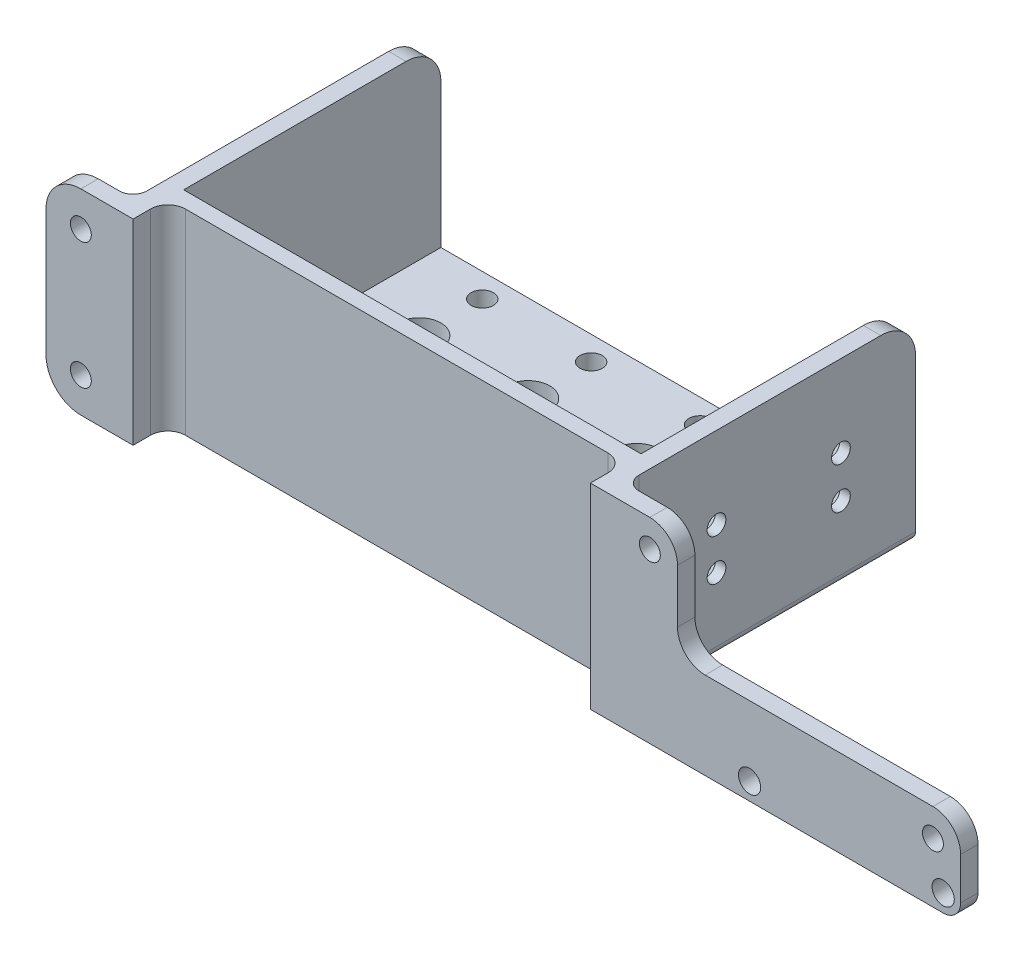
ISO-10303-21;
HEADER;
FILE_DESCRIPTION(('STEP AP214'),'2;1');
FILE_NAME('part.step','',(''),(''),'','','');
FILE_SCHEMA(('AUTOMOTIVE_DESIGN { 1 0 10303 214 1 1 1 1 }'));
ENDSEC;
DATA;
#1=APPLICATION_CONTEXT('core data for automotive mechanical design processes');
#2=APPLICATION_PROTOCOL_DEFINITION('international standard','automotive_design',2000,#1);
#3=PRODUCT_CONTEXT('',#1,'mechanical');
#4=PRODUCT('Part','Part','',(#3));
#5=PRODUCT_RELATED_PRODUCT_CATEGORY('part','',(#4));
#6=PRODUCT_DEFINITION_FORMATION('','',#4);
#7=PRODUCT_DEFINITION_CONTEXT('part definition',#1,'design');
#8=PRODUCT_DEFINITION('design','',#6,#7);
#9=PRODUCT_DEFINITION_SHAPE('','',#8);
#10=(LENGTH_UNIT() NAMED_UNIT(*) SI_UNIT(.MILLI.,.METRE.));
#11=(NAMED_UNIT(*) PLANE_ANGLE_UNIT() SI_UNIT($,.RADIAN.));
#12=(NAMED_UNIT(*) SI_UNIT($,.STERADIAN.) SOLID_ANGLE_UNIT());
#13=UNCERTAINTY_MEASURE_WITH_UNIT(LENGTH_MEASURE(1.E-05),#10,'distance_accuracy_value','');
#14=(GEOMETRIC_REPRESENTATION_CONTEXT(3) GLOBAL_UNCERTAINTY_ASSIGNED_CONTEXT((#13)) GLOBAL_UNIT_ASSIGNED_CONTEXT((#10,
#11,#12)) REPRESENTATION_CONTEXT('',''));
#15=CARTESIAN_POINT('',(0.,0.,0.));
#16=DIRECTION('',(0.,0.,1.));
#17=DIRECTION('',(1.,0.,0.));
#18=AXIS2_PLACEMENT_3D('',#15,#16,#17);
#19=CARTESIAN_POINT('',(0.,0.,4.));
#20=DIRECTION('',(0.,0.,1.));
#21=DIRECTION('',(1.,0.,0.));
#22=AXIS2_PLACEMENT_3D('',#19,#20,#21);
#23=PLANE('',#22);
#24=DIRECTION('',(0.,-1.,0.));
#25=VECTOR('',#24,1.);
#26=CARTESIAN_POINT('',(-52.500000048,45.,4.));
#27=LINE('',#26,#25);
#28=CARTESIAN_POINT('',(-52.500000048,45.,4.));
#29=VERTEX_POINT('',#28);
#30=CARTESIAN_POINT('',(-52.500000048,0.,4.));
#31=VERTEX_POINT('',#30);
#32=EDGE_CURVE('E393',#29,#31,#27,.T.);
#33=ORIENTED_EDGE('',*,*,#32,.F.);
#34=DIRECTION('',(1.,0.,0.));
#35=VECTOR('',#34,1.);
#36=CARTESIAN_POINT('',(0.,45.,4.));
#37=LINE('',#36,#35);
#38=CARTESIAN_POINT('',(-64.500000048,45.,4.));
#39=VERTEX_POINT('',#38);
#40=EDGE_CURVE('E402',#39,#29,#37,.T.);
#41=ORIENTED_EDGE('',*,*,#40,.F.);
#42=CARTESIAN_POINT('',(-64.500000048,37.,4.));
#43=DIRECTION('',(0.,0.,1.));
#44=DIRECTION('',(1.,0.,0.));
#45=AXIS2_PLACEMENT_3D('',#42,#43,#44);
#46=CIRCLE('',#45,8.);
#47=CARTESIAN_POINT('',(-72.500000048,37.,4.));
#48=VERTEX_POINT('',#47);
#49=EDGE_CURVE('E729',#39,#48,#46,.T.);
#50=ORIENTED_EDGE('',*,*,#49,.T.);
#51=DIRECTION('',(0.,1.,0.));
#52=VECTOR('',#51,1.);
#53=CARTESIAN_POINT('',(-72.500000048,0.,4.));
#54=LINE('',#53,#52);
#55=CARTESIAN_POINT('',(-72.500000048,8.,4.));
#56=VERTEX_POINT('',#55);
#57=EDGE_CURVE('E408',#56,#48,#54,.T.);
#58=ORIENTED_EDGE('',*,*,#57,.F.);
#59=CARTESIAN_POINT('',(-64.500000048,8.,4.));
#60=DIRECTION('',(0.,0.,1.));
#61=DIRECTION('',(1.,0.,0.));
#62=AXIS2_PLACEMENT_3D('',#59,#60,#61);
#63=CIRCLE('',#62,8.);
#64=CARTESIAN_POINT('',(-64.500000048,0.,4.));
#65=VERTEX_POINT('',#64);
#66=EDGE_CURVE('E732',#56,#65,#63,.T.);
#67=ORIENTED_EDGE('',*,*,#66,.T.);
#68=DIRECTION('',(1.,0.,0.));
#69=VECTOR('',#68,1.);
#70=CARTESIAN_POINT('',(0.,0.,4.));
#71=LINE('',#70,#69);
#72=EDGE_CURVE('E418',#65,#31,#71,.T.);
#73=ORIENTED_EDGE('',*,*,#72,.T.);
#74=EDGE_LOOP('',(#33,#41,#50,#58,#67,#73));
#75=FACE_BOUND('',#74,.T.);
#76=CARTESIAN_POINT('',(-64.500000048,8.,4.));
#77=DIRECTION('',(0.,0.,-1.));
#78=DIRECTION('',(-1.,0.,0.));
#79=AXIS2_PLACEMENT_3D('',#76,#77,#78);
#80=CIRCLE('',#79,2.4);
#81=CARTESIAN_POINT('',(-66.900000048,8.,4.));
#82=VERTEX_POINT('',#81);
#83=EDGE_CURVE('E831',#82,#82,#80,.T.);
#84=ORIENTED_EDGE('',*,*,#83,.T.);
#85=EDGE_LOOP('',(#84));
#86=FACE_BOUND('',#85,.T.);
#87=CARTESIAN_POINT('',(-64.500000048,37.,4.));
#88=DIRECTION('',(0.,0.,-1.));
#89=DIRECTION('',(-1.,0.,0.));
#90=AXIS2_PLACEMENT_3D('',#87,#88,#89);
#91=CIRCLE('',#90,2.4);
#92=CARTESIAN_POINT('',(-66.900000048,37.,4.));
#93=VERTEX_POINT('',#92);
#94=EDGE_CURVE('E1343',#93,#93,#91,.T.);
#95=ORIENTED_EDGE('',*,*,#94,.T.);
#96=EDGE_LOOP('',(#95));
#97=FACE_BOUND('',#96,.T.);
#98=ADVANCED_FACE('F54',(#75,#86,#97),#23,.T.);
#99=CARTESIAN_POINT('',(0.,0.,0.));
#100=DIRECTION('',(0.,0.,1.));
#101=DIRECTION('',(1.,0.,0.));
#102=AXIS2_PLACEMENT_3D('',#99,#100,#101);
#103=PLANE('',#102);
#104=CARTESIAN_POINT('',(-64.500000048,37.,0.));
#105=DIRECTION('',(0.,0.,-1.));
#106=DIRECTION('',(-1.,0.,0.));
#107=AXIS2_PLACEMENT_3D('',#104,#105,#106);
#108=CIRCLE('',#107,2.4);
#109=CARTESIAN_POINT('',(-66.900000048,37.,0.));
#110=VERTEX_POINT('',#109);
#111=EDGE_CURVE('E1339',#110,#110,#108,.T.);
#112=ORIENTED_EDGE('',*,*,#111,.F.);
#113=EDGE_LOOP('',(#112));
#114=FACE_BOUND('',#113,.T.);
#115=CARTESIAN_POINT('',(-64.500000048,8.,0.));
#116=DIRECTION('',(0.,0.,-1.));
#117=DIRECTION('',(-1.,0.,0.));
#118=AXIS2_PLACEMENT_3D('',#115,#116,#117);
#119=CIRCLE('',#118,2.4);
#120=CARTESIAN_POINT('',(-66.900000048,8.,0.));
#121=VERTEX_POINT('',#120);
#122=EDGE_CURVE('E1347',#121,#121,#119,.T.);
#123=ORIENTED_EDGE('',*,*,#122,.F.);
#124=EDGE_LOOP('',(#123));
#125=FACE_BOUND('',#124,.T.);
#126=DIRECTION('',(0.,-1.,0.));
#127=VECTOR('',#126,1.);
#128=CARTESIAN_POINT('',(-59.675000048,2.,0.));
#129=LINE('',#128,#127);
#130=CARTESIAN_POINT('',(-59.675000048,45.,0.));
#131=VERTEX_POINT('',#130);
#132=CARTESIAN_POINT('',(-59.675000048,2.,0.));
#133=VERTEX_POINT('',#132);
#134=EDGE_CURVE('E874',#131,#133,#129,.T.);
#135=ORIENTED_EDGE('',*,*,#134,.T.);
#136=CARTESIAN_POINT('',(-54.500000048,2.,0.));
#137=DIRECTION('',(0.,0.,1.));
#138=DIRECTION('',(1.,0.,0.));
#139=AXIS2_PLACEMENT_3D('',#136,#137,#138);
#140=CIRCLE('',#139,5.175);
#141=CARTESIAN_POINT('',(-59.27290534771,0.,0.));
#142=VERTEX_POINT('',#141);
#143=EDGE_CURVE('E877',#133,#142,#140,.T.);
#144=ORIENTED_EDGE('',*,*,#143,.T.);
#145=DIRECTION('',(1.,0.,0.));
#146=VECTOR('',#145,1.);
#147=CARTESIAN_POINT('',(0.,0.,0.));
#148=LINE('',#147,#146);
#149=CARTESIAN_POINT('',(-64.500000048,0.,0.));
#150=VERTEX_POINT('',#149);
#151=EDGE_CURVE('E446',#150,#142,#148,.T.);
#152=ORIENTED_EDGE('',*,*,#151,.F.);
#153=CARTESIAN_POINT('',(-64.500000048,8.,0.));
#154=DIRECTION('',(0.,0.,1.));
#155=DIRECTION('',(1.,0.,0.));
#156=AXIS2_PLACEMENT_3D('',#153,#154,#155);
#157=CIRCLE('',#156,8.);
#158=CARTESIAN_POINT('',(-72.500000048,8.,0.));
#159=VERTEX_POINT('',#158);
#160=EDGE_CURVE('E719',#150,#159,#157,.F.);
#161=ORIENTED_EDGE('',*,*,#160,.T.);
#162=DIRECTION('',(0.,1.,0.));
#163=VECTOR('',#162,1.);
#164=CARTESIAN_POINT('',(-72.500000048,0.,0.));
#165=LINE('',#164,#163);
#166=CARTESIAN_POINT('',(-72.500000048,37.,0.));
#167=VERTEX_POINT('',#166);
#168=EDGE_CURVE('E440',#159,#167,#165,.T.);
#169=ORIENTED_EDGE('',*,*,#168,.T.);
#170=CARTESIAN_POINT('',(-64.500000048,37.,0.));
#171=DIRECTION('',(0.,0.,1.));
#172=DIRECTION('',(1.,0.,0.));
#173=AXIS2_PLACEMENT_3D('',#170,#171,#172);
#174=CIRCLE('',#173,8.);
#175=CARTESIAN_POINT('',(-64.500000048,45.,0.));
#176=VERTEX_POINT('',#175);
#177=EDGE_CURVE('E716',#167,#176,#174,.F.);
#178=ORIENTED_EDGE('',*,*,#177,.T.);
#179=DIRECTION('',(1.,0.,0.));
#180=VECTOR('',#179,1.);
#181=CARTESIAN_POINT('',(0.,45.,0.));
#182=LINE('',#181,#180);
#183=EDGE_CURVE('E436',#176,#131,#182,.T.);
#184=ORIENTED_EDGE('',*,*,#183,.T.);
#185=EDGE_LOOP('',(#135,#144,#152,#161,#169,#178,#184));
#186=FACE_BOUND('',#185,.T.);
#187=ADVANCED_FACE('F1001',(#114,#125,#186),#103,.F.);
#188=CARTESIAN_POINT('',(133.49999992,4.000000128,0.));
#189=DIRECTION('',(0.,0.,-1.));
#190=DIRECTION('',(-1.,0.,0.));
#191=AXIS2_PLACEMENT_3D('',#188,#189,#190);
#192=CIRCLE('',#191,2.55269999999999);
#193=CARTESIAN_POINT('',(130.94729992,4.000000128,0.));
#194=VERTEX_POINT('',#193);
#195=EDGE_CURVE('E796',#194,#194,#192,.T.);
#196=ORIENTED_EDGE('',*,*,#195,.F.);
#197=EDGE_LOOP('',(#196));
#198=FACE_BOUND('',#197,.T.);
#199=CARTESIAN_POINT('',(89.04999992,4.000000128,0.));
#200=DIRECTION('',(0.,0.,-1.));
#201=DIRECTION('',(-1.,0.,0.));
#202=AXIS2_PLACEMENT_3D('',#199,#200,#201);
#203=CIRCLE('',#202,2.55270000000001);
#204=CARTESIAN_POINT('',(86.49729992,4.000000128,0.));
#205=VERTEX_POINT('',#204);
#206=EDGE_CURVE('E1315',#205,#205,#203,.T.);
#207=ORIENTED_EDGE('',*,*,#206,.F.);
#208=EDGE_LOOP('',(#207));
#209=FACE_BOUND('',#208,.T.);
#210=CARTESIAN_POINT('',(66.150000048,38.65,0.));
#211=DIRECTION('',(0.,0.,-1.));
#212=DIRECTION('',(-1.,0.,0.));
#213=AXIS2_PLACEMENT_3D('',#210,#211,#212);
#214=CIRCLE('',#213,2.4);
#215=CARTESIAN_POINT('',(63.750000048,38.65,0.));
#216=VERTEX_POINT('',#215);
#217=EDGE_CURVE('E1323',#216,#216,#214,.T.);
#218=ORIENTED_EDGE('',*,*,#217,.F.);
#219=EDGE_LOOP('',(#218));
#220=FACE_BOUND('',#219,.T.);
#221=CARTESIAN_POINT('',(131.150000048,13.65,0.));
#222=DIRECTION('',(0.,0.,-1.));
#223=DIRECTION('',(-1.,0.,0.));
#224=AXIS2_PLACEMENT_3D('',#221,#222,#223);
#225=CIRCLE('',#224,2.39999999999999);
#226=CARTESIAN_POINT('',(128.750000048,13.65,0.));
#227=VERTEX_POINT('',#226);
#228=EDGE_CURVE('E1331',#227,#227,#225,.T.);
#229=ORIENTED_EDGE('',*,*,#228,.F.);
#230=EDGE_LOOP('',(#229));
#231=FACE_BOUND('',#230,.T.);
#232=CARTESIAN_POINT('',(59.27290534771,0.,0.));
#233=VERTEX_POINT('',#232);
#234=CARTESIAN_POINT('',(133.49999992,0.,0.));
#235=VERTEX_POINT('',#234);
#236=EDGE_CURVE('E445',#233,#235,#148,.T.);
#237=ORIENTED_EDGE('',*,*,#236,.F.);
#238=CARTESIAN_POINT('',(54.500000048,2.,0.));
#239=DIRECTION('',(0.,0.,1.));
#240=DIRECTION('',(1.,0.,0.));
#241=AXIS2_PLACEMENT_3D('',#238,#239,#240);
#242=CIRCLE('',#241,5.175);
#243=CARTESIAN_POINT('',(59.675000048,2.,0.));
#244=VERTEX_POINT('',#243);
#245=EDGE_CURVE('E887',#233,#244,#242,.T.);
#246=ORIENTED_EDGE('',*,*,#245,.T.);
#247=DIRECTION('',(0.,-1.,0.));
#248=VECTOR('',#247,1.);
#249=CARTESIAN_POINT('',(59.675000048,45.,0.));
#250=LINE('',#249,#248);
#251=CARTESIAN_POINT('',(59.675000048,45.,0.));
#252=VERTEX_POINT('',#251);
#253=EDGE_CURVE('E884',#244,#252,#250,.F.);
#254=ORIENTED_EDGE('',*,*,#253,.T.);
#255=CARTESIAN_POINT('',(66.150000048,45.,0.));
#256=VERTEX_POINT('',#255);
#257=EDGE_CURVE('E434',#252,#256,#182,.T.);
#258=ORIENTED_EDGE('',*,*,#257,.T.);
#259=CARTESIAN_POINT('',(66.150000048,38.65,0.));
#260=DIRECTION('',(0.,0.,1.));
#261=DIRECTION('',(1.,0.,0.));
#262=AXIS2_PLACEMENT_3D('',#259,#260,#261);
#263=CIRCLE('',#262,6.35);
#264=CARTESIAN_POINT('',(72.500000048,38.65,0.));
#265=VERTEX_POINT('',#264);
#266=EDGE_CURVE('E768',#256,#265,#263,.F.);
#267=ORIENTED_EDGE('',*,*,#266,.T.);
#268=DIRECTION('',(0.,-1.,0.));
#269=VECTOR('',#268,1.);
#270=CARTESIAN_POINT('',(72.500000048,0.,0.));
#271=LINE('',#270,#269);
#272=CARTESIAN_POINT('',(72.500000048,26.35,0.));
#273=VERTEX_POINT('',#272);
#274=EDGE_CURVE('E430',#265,#273,#271,.T.);
#275=ORIENTED_EDGE('',*,*,#274,.T.);
#276=CARTESIAN_POINT('',(78.850000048,26.35,0.));
#277=DIRECTION('',(0.,0.,1.));
#278=DIRECTION('',(1.,0.,0.));
#279=AXIS2_PLACEMENT_3D('',#276,#277,#278);
#280=CIRCLE('',#279,6.35);
#281=CARTESIAN_POINT('',(78.850000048,20.,0.));
#282=VERTEX_POINT('',#281);
#283=EDGE_CURVE('E785',#273,#282,#280,.T.);
#284=ORIENTED_EDGE('',*,*,#283,.T.);
#285=DIRECTION('',(-1.,0.,0.));
#286=VECTOR('',#285,1.);
#287=CARTESIAN_POINT('',(0.,20.,0.));
#288=LINE('',#287,#286);
#289=CARTESIAN_POINT('',(131.150000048,20.,0.));
#290=VERTEX_POINT('',#289);
#291=EDGE_CURVE('E410',#290,#282,#288,.T.);
#292=ORIENTED_EDGE('',*,*,#291,.F.);
#293=CARTESIAN_POINT('',(131.150000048,13.65,0.));
#294=DIRECTION('',(0.,0.,1.));
#295=DIRECTION('',(1.,0.,0.));
#296=AXIS2_PLACEMENT_3D('',#293,#294,#295);
#297=CIRCLE('',#296,6.35);
#298=CARTESIAN_POINT('',(137.500000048,13.65,0.));
#299=VERTEX_POINT('',#298);
#300=EDGE_CURVE('E771',#290,#299,#297,.F.);
#301=ORIENTED_EDGE('',*,*,#300,.T.);
#302=DIRECTION('',(0.,-1.,0.));
#303=VECTOR('',#302,1.);
#304=CARTESIAN_POINT('',(137.500000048,0.,0.));
#305=LINE('',#304,#303);
#306=CARTESIAN_POINT('',(137.500000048,4.000000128,0.));
#307=VERTEX_POINT('',#306);
#308=EDGE_CURVE('E450',#299,#307,#305,.T.);
#309=ORIENTED_EDGE('',*,*,#308,.T.);
#310=CARTESIAN_POINT('',(133.49999992,4.000000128,0.));
#311=DIRECTION('',(0.,0.,1.));
#312=DIRECTION('',(1.,0.,0.));
#313=AXIS2_PLACEMENT_3D('',#310,#311,#312);
#314=CIRCLE('',#313,4.000000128);
#315=EDGE_CURVE('E742',#307,#235,#314,.F.);
#316=ORIENTED_EDGE('',*,*,#315,.T.);
#317=EDGE_LOOP('',(#237,#246,#254,#258,#267,#275,#284,#292,#301,#309,#316));
#318=FACE_BOUND('',#317,.T.);
#319=ADVANCED_FACE('F946',(#198,#209,#220,#231,#318),#103,.F.);
#320=CARTESIAN_POINT('',(37.50000002,4.,-14.175));
#321=DIRECTION('',(0.,1.,0.));
#322=DIRECTION('',(0.,0.,1.));
#323=AXIS2_PLACEMENT_3D('',#320,#321,#322);
#324=CYLINDRICAL_SURFACE('',#323,2.5527);
#325=CARTESIAN_POINT('',(37.50000002,0.,-14.175));
#326=DIRECTION('',(0.,1.,0.));
#327=DIRECTION('',(0.,0.,1.));
#328=AXIS2_PLACEMENT_3D('',#325,#326,#327);
#329=CIRCLE('',#328,2.5527);
#330=CARTESIAN_POINT('',(37.50000002,0.,-11.6223));
#331=VERTEX_POINT('',#330);
#332=EDGE_CURVE('E704',#331,#331,#329,.T.);
#333=ORIENTED_EDGE('',*,*,#332,.F.);
#334=EDGE_LOOP('',(#333));
#335=FACE_BOUND('',#334,.T.);
#336=CARTESIAN_POINT('',(37.50000002,4.,-14.175));
#337=DIRECTION('',(0.,1.,0.));
#338=DIRECTION('',(0.,0.,1.));
#339=AXIS2_PLACEMENT_3D('',#336,#337,#338);
#340=CIRCLE('',#339,2.5527);
#341=CARTESIAN_POINT('',(37.50000002,4.,-11.6223));
#342=VERTEX_POINT('',#341);
#343=EDGE_CURVE('E708',#342,#342,#340,.T.);
#344=ORIENTED_EDGE('',*,*,#343,.T.);
#345=EDGE_LOOP('',(#344));
#346=FACE_BOUND('',#345,.T.);
#347=ADVANCED_FACE('F942',(#335,#346),#324,.F.);
#348=CARTESIAN_POINT('',(12.50000002,4.,-14.175));
#349=DIRECTION('',(0.,1.,0.));
#350=DIRECTION('',(0.,0.,1.));
#351=AXIS2_PLACEMENT_3D('',#348,#349,#350);
#352=CYLINDRICAL_SURFACE('',#351,2.5527);
#353=CARTESIAN_POINT('',(12.50000002,0.,-14.175));
#354=DIRECTION('',(0.,1.,0.));
#355=DIRECTION('',(0.,0.,1.));
#356=AXIS2_PLACEMENT_3D('',#353,#354,#355);
#357=CIRCLE('',#356,2.5527);
#358=CARTESIAN_POINT('',(12.50000002,0.,-11.6223));
#359=VERTEX_POINT('',#358);
#360=EDGE_CURVE('E696',#359,#359,#357,.T.);
#361=ORIENTED_EDGE('',*,*,#360,.F.);
#362=EDGE_LOOP('',(#361));
#363=FACE_BOUND('',#362,.T.);
#364=CARTESIAN_POINT('',(12.50000002,4.,-14.175));
#365=DIRECTION('',(0.,1.,0.));
#366=DIRECTION('',(0.,0.,1.));
#367=AXIS2_PLACEMENT_3D('',#364,#365,#366);
#368=CIRCLE('',#367,2.5527);
#369=CARTESIAN_POINT('',(12.50000002,4.,-11.6223));
#370=VERTEX_POINT('',#369);
#371=EDGE_CURVE('E700',#370,#370,#368,.T.);
#372=ORIENTED_EDGE('',*,*,#371,.T.);
#373=EDGE_LOOP('',(#372));
#374=FACE_BOUND('',#373,.T.);
#375=ADVANCED_FACE('F938',(#363,#374),#352,.F.);
#376=CARTESIAN_POINT('',(37.50000002,4.,-61.175));
#377=DIRECTION('',(0.,1.,0.));
#378=DIRECTION('',(0.,0.,1.));
#379=AXIS2_PLACEMENT_3D('',#376,#377,#378);
#380=CYLINDRICAL_SURFACE('',#379,2.5527);
#381=CARTESIAN_POINT('',(37.50000002,0.,-61.175));
#382=DIRECTION('',(0.,1.,0.));
#383=DIRECTION('',(0.,0.,1.));
#384=AXIS2_PLACEMENT_3D('',#381,#382,#383);
#385=CIRCLE('',#384,2.5527);
#386=CARTESIAN_POINT('',(37.50000002,0.,-58.6223));
#387=VERTEX_POINT('',#386);
#388=EDGE_CURVE('E688',#387,#387,#385,.T.);
#389=ORIENTED_EDGE('',*,*,#388,.F.);
#390=EDGE_LOOP('',(#389));
#391=FACE_BOUND('',#390,.T.);
#392=CARTESIAN_POINT('',(37.50000002,4.,-61.175));
#393=DIRECTION('',(0.,1.,0.));
#394=DIRECTION('',(0.,0.,1.));
#395=AXIS2_PLACEMENT_3D('',#392,#393,#394);
#396=CIRCLE('',#395,2.5527);
#397=CARTESIAN_POINT('',(37.50000002,4.,-58.6223));
#398=VERTEX_POINT('',#397);
#399=EDGE_CURVE('E692',#398,#398,#396,.T.);
#400=ORIENTED_EDGE('',*,*,#399,.T.);
#401=EDGE_LOOP('',(#400));
#402=FACE_BOUND('',#401,.T.);
#403=ADVANCED_FACE('F934',(#391,#402),#380,.F.);
#404=CARTESIAN_POINT('',(12.50000002,4.,-61.175));
#405=DIRECTION('',(0.,1.,0.));
#406=DIRECTION('',(0.,0.,1.));
#407=AXIS2_PLACEMENT_3D('',#404,#405,#406);
#408=CYLINDRICAL_SURFACE('',#407,2.5527);
#409=CARTESIAN_POINT('',(12.50000002,0.,-61.175));
#410=DIRECTION('',(0.,1.,0.));
#411=DIRECTION('',(0.,0.,1.));
#412=AXIS2_PLACEMENT_3D('',#409,#410,#411);
#413=CIRCLE('',#412,2.5527);
#414=CARTESIAN_POINT('',(12.50000002,0.,-58.6223));
#415=VERTEX_POINT('',#414);
#416=EDGE_CURVE('E677',#415,#415,#413,.T.);
#417=ORIENTED_EDGE('',*,*,#416,.F.);
#418=EDGE_LOOP('',(#417));
#419=FACE_BOUND('',#418,.T.);
#420=CARTESIAN_POINT('',(12.50000002,4.,-61.175));
#421=DIRECTION('',(0.,1.,0.));
#422=DIRECTION('',(0.,0.,1.));
#423=AXIS2_PLACEMENT_3D('',#420,#421,#422);
#424=CIRCLE('',#423,2.5527);
#425=CARTESIAN_POINT('',(12.50000002,4.,-58.6223));
#426=VERTEX_POINT('',#425);
#427=EDGE_CURVE('E684',#426,#426,#424,.T.);
#428=ORIENTED_EDGE('',*,*,#427,.T.);
#429=EDGE_LOOP('',(#428));
#430=FACE_BOUND('',#429,.T.);
#431=ADVANCED_FACE('F924',(#419,#430),#408,.F.);
#432=CARTESIAN_POINT('',(0.,0.,0.));
#433=DIRECTION('',(0.,-1.,0.));
#434=DIRECTION('',(0.,0.,-1.));
#435=AXIS2_PLACEMENT_3D('',#432,#433,#434);
#436=PLANE('',#435);
#437=ORIENTED_EDGE('',*,*,#151,.T.);
#438=CARTESIAN_POINT('',(-59.27290534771,0.,0.));
#439=CARTESIAN_POINT('',(-59.1625469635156,0.,1.62191258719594E-05));
#440=CARTESIAN_POINT('',(-59.0522226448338,0.,-0.00489287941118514));
#441=CARTESIAN_POINT('',(-58.8324962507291,0.,-0.0241254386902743));
#442=CARTESIAN_POINT('',(-58.7230934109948,0.,-0.0384401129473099));
#443=CARTESIAN_POINT('',(-58.50666204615,0.,-0.0759094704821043));
#444=CARTESIAN_POINT('',(-58.3996219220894,0.,-0.0989977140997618));
#445=CARTESIAN_POINT('',(-58.1876653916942,0.,-0.153512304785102));
#446=CARTESIAN_POINT('',(-58.0827496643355,0.,-0.18494127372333));
#447=CARTESIAN_POINT('',(-57.8480781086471,0.,-0.26495062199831));
#448=CARTESIAN_POINT('',(-57.7191164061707,0.,-0.315869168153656));
#449=CARTESIAN_POINT('',(-57.4662162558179,0.,-0.428919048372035));
#450=CARTESIAN_POINT('',(-57.3422788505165,0.,-0.491052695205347));
#451=CARTESIAN_POINT('',(-57.0996808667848,0.,-0.625359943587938));
#452=CARTESIAN_POINT('',(-56.9810309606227,0.,-0.69755273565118));
#453=CARTESIAN_POINT('',(-56.7494196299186,0.,-0.85058344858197));
#454=CARTESIAN_POINT('',(-56.6364604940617,0.,-0.931424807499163));
#455=CARTESIAN_POINT('',(-56.3311298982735,0.,-1.165741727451));
#456=CARTESIAN_POINT('',(-56.1447964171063,0.,-1.32709839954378));
#457=CARTESIAN_POINT('',(-55.7876308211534,0.,-1.66615992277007));
#458=CARTESIAN_POINT('',(-55.6168166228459,0.,-1.84388320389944));
#459=CARTESIAN_POINT('',(-55.1211506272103,0.,-2.39297861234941));
#460=CARTESIAN_POINT('',(-54.8137449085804,0.,-2.77969849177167));
#461=CARTESIAN_POINT('',(-54.5046705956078,0.,-3.16911528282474));
#462=CARTESIAN_POINT('',(-54.5023353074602,0.,-3.17205765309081));
#463=CARTESIAN_POINT('',(-54.500000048,0.,-3.175));
#464=B_SPLINE_CURVE_WITH_KNOTS('',3,(#438,#439,#440,#441,#442,#443,#444,#445,#446,#447,#448,
#449,#450,#451,#452,#453,#454,#455,#456,#457,#458,#459,#460,#461,#462,#463),.UNSPECIFIED.,.F.,
.F.,(4,2,2,2,2,2,2,2,2,2,2,2,4),(0.,0.330915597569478,0.661522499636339,0.989674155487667,
1.31792908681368,1.73326799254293,2.14869264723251,2.56492097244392,2.98131537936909,
3.71926466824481,4.4580553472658,5.93826480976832,5.94953423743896),.UNSPECIFIED.);
#465=CARTESIAN_POINT('',(-54.500000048,0.,-3.175));
#466=VERTEX_POINT('',#465);
#467=EDGE_CURVE('E899',#142,#466,#464,.T.);
#468=ORIENTED_EDGE('',*,*,#467,.T.);
#469=DIRECTION('',(0.,0.,-1.));
#470=VECTOR('',#469,1.);
#471=CARTESIAN_POINT('',(-54.500000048,0.,-66.675));
#472=LINE('',#471,#470);
#473=CARTESIAN_POINT('',(-54.500000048,0.,-66.675));
#474=VERTEX_POINT('',#473);
#475=EDGE_CURVE('E859',#466,#474,#472,.T.);
#476=ORIENTED_EDGE('',*,*,#475,.T.);
#477=DIRECTION('',(-1.,0.,0.));
#478=VECTOR('',#477,1.);
#479=CARTESIAN_POINT('',(-52.500000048,0.,-66.675));
#480=LINE('',#479,#478);
#481=CARTESIAN_POINT('',(54.500000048,0.,-66.675));
#482=VERTEX_POINT('',#481);
#483=EDGE_CURVE('E654',#482,#474,#480,.T.);
#484=ORIENTED_EDGE('',*,*,#483,.F.);
#485=DIRECTION('',(0.,0.,-1.));
#486=VECTOR('',#485,1.);
#487=CARTESIAN_POINT('',(54.500000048,0.,0.));
#488=LINE('',#487,#486);
#489=CARTESIAN_POINT('',(54.500000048,0.,-3.175));
#490=VERTEX_POINT('',#489);
#491=EDGE_CURVE('E855',#482,#490,#488,.F.);
#492=ORIENTED_EDGE('',*,*,#491,.T.);
#493=CARTESIAN_POINT('',(59.27290534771,0.,0.));
#494=CARTESIAN_POINT('',(59.1625469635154,0.,1.62191258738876E-05));
#495=CARTESIAN_POINT('',(59.0522226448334,0.,-0.00489287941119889));
#496=CARTESIAN_POINT('',(58.8324962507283,0.,-0.024125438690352));
#497=CARTESIAN_POINT('',(58.7230934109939,0.,-0.0384401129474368));
#498=CARTESIAN_POINT('',(58.5066620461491,0.,-0.0759094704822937));
#499=CARTESIAN_POINT('',(58.3996219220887,0.,-0.0989977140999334));
#500=CARTESIAN_POINT('',(58.1876653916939,0.,-0.153512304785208));
#501=CARTESIAN_POINT('',(58.0827496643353,0.,-0.184941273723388));
#502=CARTESIAN_POINT('',(57.8480781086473,0.,-0.264950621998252));
#503=CARTESIAN_POINT('',(57.719116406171,0.,-0.315869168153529));
#504=CARTESIAN_POINT('',(57.4662162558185,0.,-0.428919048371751));
#505=CARTESIAN_POINT('',(57.3422788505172,0.,-0.491052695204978));
#506=CARTESIAN_POINT('',(57.0996808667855,0.,-0.625359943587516));
#507=CARTESIAN_POINT('',(56.9810309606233,0.,-0.697552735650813));
#508=CARTESIAN_POINT('',(56.7494196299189,0.,-0.850583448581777));
#509=CARTESIAN_POINT('',(56.6364604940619,0.,-0.93142480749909));
#510=CARTESIAN_POINT('',(56.3311298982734,0.,-1.16574172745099));
#511=CARTESIAN_POINT('',(56.1447964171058,0.,-1.32709839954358));
#512=CARTESIAN_POINT('',(55.7876308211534,0.,-1.66615992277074));
#513=CARTESIAN_POINT('',(55.6168166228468,0.,-1.84388320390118));
#514=CARTESIAN_POINT('',(55.1211506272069,0.,-2.39297861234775));
#515=CARTESIAN_POINT('',(54.8137449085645,0.,-2.77969849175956));
#516=CARTESIAN_POINT('',(54.5046705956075,0.,-3.16911528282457));
#517=CARTESIAN_POINT('',(54.5023353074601,0.,-3.17205765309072));
#518=CARTESIAN_POINT('',(54.500000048,0.,-3.175));
#519=B_SPLINE_CURVE_WITH_KNOTS('',3,(#493,#494,#495,#496,#497,#498,#499,#500,#501,#502,#503,
#504,#505,#506,#507,#508,#509,#510,#511,#512,#513,#514,#515,#516,#517,#518),.UNSPECIFIED.,.F.,
.F.,(4,2,2,2,2,2,2,2,2,2,2,2,4),(0.,0.330915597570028,0.661522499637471,0.989674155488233,
1.31792908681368,1.73326799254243,2.14869264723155,2.56492097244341,2.98131537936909,
3.71926466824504,4.45805534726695,5.93826480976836,5.94953423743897),.UNSPECIFIED.);
#520=EDGE_CURVE('E908',#490,#233,#519,.F.);
#521=ORIENTED_EDGE('',*,*,#520,.T.);
#522=ORIENTED_EDGE('',*,*,#236,.T.);
#523=DIRECTION('',(0.,0.,-1.));
#524=VECTOR('',#523,1.);
#525=CARTESIAN_POINT('',(133.49999992,0.,0.));
#526=LINE('',#525,#524);
#527=CARTESIAN_POINT('',(133.49999992,0.,4.));
#528=VERTEX_POINT('',#527);
#529=EDGE_CURVE('E746',#235,#528,#526,.F.);
#530=ORIENTED_EDGE('',*,*,#529,.T.);
#531=CARTESIAN_POINT('',(52.500000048,0.,4.));
#532=VERTEX_POINT('',#531);
#533=EDGE_CURVE('E417',#532,#528,#71,.T.);
#534=ORIENTED_EDGE('',*,*,#533,.F.);
#535=DIRECTION('',(0.,0.,1.));
#536=VECTOR('',#535,1.);
#537=CARTESIAN_POINT('',(52.500000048,0.,4.));
#538=LINE('',#537,#536);
#539=CARTESIAN_POINT('',(52.500000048,0.,1.28000000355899E-07));
#540=VERTEX_POINT('',#539);
#541=EDGE_CURVE('E389',#540,#532,#538,.T.);
#542=ORIENTED_EDGE('',*,*,#541,.F.);
#543=CARTESIAN_POINT('',(48.49999992,0.,1.28000000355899E-07));
#544=DIRECTION('',(0.,-1.,0.));
#545=DIRECTION('',(0.,0.,-1.));
#546=AXIS2_PLACEMENT_3D('',#543,#544,#545);
#547=CIRCLE('',#546,4.000000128);
#548=CARTESIAN_POINT('',(48.49999992,0.,-4.));
#549=VERTEX_POINT('',#548);
#550=EDGE_CURVE('E850',#540,#549,#547,.F.);
#551=ORIENTED_EDGE('',*,*,#550,.T.);
#552=DIRECTION('',(1.,0.,0.));
#553=VECTOR('',#552,1.);
#554=CARTESIAN_POINT('',(-52.500000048,0.,-4.));
#555=LINE('',#554,#553);
#556=CARTESIAN_POINT('',(-48.49999992,0.,-4.));
#557=VERTEX_POINT('',#556);
#558=EDGE_CURVE('E1246',#557,#549,#555,.T.);
#559=ORIENTED_EDGE('',*,*,#558,.F.);
#560=CARTESIAN_POINT('',(-48.49999992,0.,1.27999999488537E-07));
#561=DIRECTION('',(0.,-1.,0.));
#562=DIRECTION('',(0.,0.,-1.));
#563=AXIS2_PLACEMENT_3D('',#560,#561,#562);
#564=CIRCLE('',#563,4.000000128);
#565=CARTESIAN_POINT('',(-52.500000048,0.,1.27999999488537E-07));
#566=VERTEX_POINT('',#565);
#567=EDGE_CURVE('E844',#557,#566,#564,.F.);
#568=ORIENTED_EDGE('',*,*,#567,.T.);
#569=DIRECTION('',(0.,0.,-1.));
#570=VECTOR('',#569,1.);
#571=CARTESIAN_POINT('',(-52.500000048,0.,4.));
#572=LINE('',#571,#570);
#573=EDGE_CURVE('E1238',#31,#566,#572,.T.);
#574=ORIENTED_EDGE('',*,*,#573,.F.);
#575=ORIENTED_EDGE('',*,*,#72,.F.);
#576=DIRECTION('',(0.,0.,-1.));
#577=VECTOR('',#576,1.);
#578=CARTESIAN_POINT('',(-64.500000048,0.,0.));
#579=LINE('',#578,#577);
#580=EDGE_CURVE('E712',#65,#150,#579,.T.);
#581=ORIENTED_EDGE('',*,*,#580,.T.);
#582=EDGE_LOOP('',(#437,#468,#476,#484,#492,#521,#522,#530,#534,#542,#551,#559,#568,#574,#575,#581));
#583=FACE_BOUND('',#582,.T.);
#584=CARTESIAN_POINT('',(-12.49999998,0.,-14.175));
#585=DIRECTION('',(0.,1.,0.));
#586=DIRECTION('',(0.,0.,1.));
#587=AXIS2_PLACEMENT_3D('',#584,#585,#586);
#588=CIRCLE('',#587,2.5527);
#589=CARTESIAN_POINT('',(-12.49999998,0.,-11.6223));
#590=VERTEX_POINT('',#589);
#591=EDGE_CURVE('E429',#590,#590,#588,.T.);
#592=ORIENTED_EDGE('',*,*,#591,.T.);
#593=EDGE_LOOP('',(#592));
#594=FACE_BOUND('',#593,.T.);
#595=CARTESIAN_POINT('',(-12.49999998,0.,-61.175));
#596=DIRECTION('',(0.,1.,0.));
#597=DIRECTION('',(0.,0.,1.));
#598=AXIS2_PLACEMENT_3D('',#595,#596,#597);
#599=CIRCLE('',#598,2.5527);
#600=CARTESIAN_POINT('',(-12.49999998,0.,-58.6223));
#601=VERTEX_POINT('',#600);
#602=EDGE_CURVE('E463',#601,#601,#599,.T.);
#603=ORIENTED_EDGE('',*,*,#602,.T.);
#604=EDGE_LOOP('',(#603));
#605=FACE_BOUND('',#604,.T.);
#606=CARTESIAN_POINT('',(-12.49999998,0.,-46.675));
#607=DIRECTION('',(0.,1.,0.));
#608=DIRECTION('',(0.,0.,1.));
#609=AXIS2_PLACEMENT_3D('',#606,#607,#608);
#610=CIRCLE('',#609,4.99999999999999);
#611=CARTESIAN_POINT('',(-7.49999998,0.,-46.675));
#612=VERTEX_POINT('',#611);
#613=CARTESIAN_POINT('',(-17.49999998,0.,-46.675));
#614=VERTEX_POINT('',#613);
#615=EDGE_CURVE('E472',#612,#614,#610,.T.);
#616=ORIENTED_EDGE('',*,*,#615,.T.);
#617=DIRECTION('',(0.,0.,1.));
#618=VECTOR('',#617,1.);
#619=CARTESIAN_POINT('',(-17.49999998,0.,-46.675));
#620=LINE('',#619,#618);
#621=CARTESIAN_POINT('',(-17.49999998,0.,-28.675));
#622=VERTEX_POINT('',#621);
#623=EDGE_CURVE('E476',#614,#622,#620,.T.);
#624=ORIENTED_EDGE('',*,*,#623,.T.);
#625=CARTESIAN_POINT('',(-12.49999998,0.,-28.675));
#626=DIRECTION('',(0.,1.,0.));
#627=DIRECTION('',(0.,0.,1.));
#628=AXIS2_PLACEMENT_3D('',#625,#626,#627);
#629=CIRCLE('',#628,4.99999999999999);
#630=CARTESIAN_POINT('',(-7.49999997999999,0.,-28.675));
#631=VERTEX_POINT('',#630);
#632=EDGE_CURVE('E481',#622,#631,#629,.T.);
#633=ORIENTED_EDGE('',*,*,#632,.T.);
#634=DIRECTION('',(0.,0.,-1.));
#635=VECTOR('',#634,1.);
#636=CARTESIAN_POINT('',(-7.49999998,0.,-46.675));
#637=LINE('',#636,#635);
#638=EDGE_CURVE('E485',#631,#612,#637,.T.);
#639=ORIENTED_EDGE('',*,*,#638,.T.);
#640=EDGE_LOOP('',(#616,#624,#633,#639));
#641=FACE_BOUND('',#640,.T.);
#642=CARTESIAN_POINT('',(12.50000002,0.,-46.675));
#643=DIRECTION('',(0.,1.,0.));
#644=DIRECTION('',(0.,0.,1.));
#645=AXIS2_PLACEMENT_3D('',#642,#643,#644);
#646=CIRCLE('',#645,4.99999999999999);
#647=CARTESIAN_POINT('',(17.50000002,0.,-46.675));
#648=VERTEX_POINT('',#647);
#649=CARTESIAN_POINT('',(7.50000002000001,0.,-46.675));
#650=VERTEX_POINT('',#649);
#651=EDGE_CURVE('E518',#648,#650,#646,.T.);
#652=ORIENTED_EDGE('',*,*,#651,.T.);
#653=DIRECTION('',(0.,0.,1.));
#654=VECTOR('',#653,1.);
#655=CARTESIAN_POINT('',(7.50000002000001,0.,-46.675));
#656=LINE('',#655,#654);
#657=CARTESIAN_POINT('',(7.50000002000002,0.,-28.675));
#658=VERTEX_POINT('',#657);
#659=EDGE_CURVE('E522',#650,#658,#656,.T.);
#660=ORIENTED_EDGE('',*,*,#659,.T.);
#661=CARTESIAN_POINT('',(12.50000002,0.,-28.675));
#662=DIRECTION('',(0.,1.,0.));
#663=DIRECTION('',(0.,0.,1.));
#664=AXIS2_PLACEMENT_3D('',#661,#662,#663);
#665=CIRCLE('',#664,4.99999999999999);
#666=CARTESIAN_POINT('',(17.50000002,0.,-28.675));
#667=VERTEX_POINT('',#666);
#668=EDGE_CURVE('E527',#658,#667,#665,.T.);
#669=ORIENTED_EDGE('',*,*,#668,.T.);
#670=DIRECTION('',(0.,0.,-1.));
#671=VECTOR('',#670,1.);
#672=CARTESIAN_POINT('',(17.50000002,0.,-46.675));
#673=LINE('',#672,#671);
#674=EDGE_CURVE('E531',#667,#648,#673,.T.);
#675=ORIENTED_EDGE('',*,*,#674,.T.);
#676=EDGE_LOOP('',(#652,#660,#669,#675));
#677=FACE_BOUND('',#676,.T.);
#678=CARTESIAN_POINT('',(37.50000002,0.,-46.675));
#679=DIRECTION('',(0.,1.,0.));
#680=DIRECTION('',(0.,0.,1.));
#681=AXIS2_PLACEMENT_3D('',#678,#679,#680);
#682=CIRCLE('',#681,4.99999999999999);
#683=CARTESIAN_POINT('',(42.50000002,0.,-46.675));
#684=VERTEX_POINT('',#683);
#685=CARTESIAN_POINT('',(32.50000002,0.,-46.675));
#686=VERTEX_POINT('',#685);
#687=EDGE_CURVE('E562',#684,#686,#682,.T.);
#688=ORIENTED_EDGE('',*,*,#687,.T.);
#689=DIRECTION('',(0.,0.,1.));
#690=VECTOR('',#689,1.);
#691=CARTESIAN_POINT('',(32.50000002,0.,-46.675));
#692=LINE('',#691,#690);
#693=CARTESIAN_POINT('',(32.50000002,0.,-28.675));
#694=VERTEX_POINT('',#693);
#695=EDGE_CURVE('E566',#686,#694,#692,.T.);
#696=ORIENTED_EDGE('',*,*,#695,.T.);
#697=CARTESIAN_POINT('',(37.50000002,0.,-28.675));
#698=DIRECTION('',(0.,1.,0.));
#699=DIRECTION('',(0.,0.,1.));
#700=AXIS2_PLACEMENT_3D('',#697,#698,#699);
#701=CIRCLE('',#700,4.99999999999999);
#702=CARTESIAN_POINT('',(42.50000002,0.,-28.675));
#703=VERTEX_POINT('',#702);
#704=EDGE_CURVE('E571',#694,#703,#701,.T.);
#705=ORIENTED_EDGE('',*,*,#704,.T.);
#706=DIRECTION('',(0.,0.,-1.));
#707=VECTOR('',#706,1.);
#708=CARTESIAN_POINT('',(42.50000002,0.,-46.675));
#709=LINE('',#708,#707);
#710=EDGE_CURVE('E575',#703,#684,#709,.T.);
#711=ORIENTED_EDGE('',*,*,#710,.T.);
#712=EDGE_LOOP('',(#688,#696,#705,#711));
#713=FACE_BOUND('',#712,.T.);
#714=CARTESIAN_POINT('',(-37.49999998,0.,-61.175));
#715=DIRECTION('',(0.,1.,0.));
#716=DIRECTION('',(0.,0.,1.));
#717=AXIS2_PLACEMENT_3D('',#714,#715,#716);
#718=CIRCLE('',#717,2.5527);
#719=CARTESIAN_POINT('',(-37.49999998,0.,-58.6223));
#720=VERTEX_POINT('',#719);
#721=EDGE_CURVE('E607',#720,#720,#718,.T.);
#722=ORIENTED_EDGE('',*,*,#721,.T.);
#723=EDGE_LOOP('',(#722));
#724=FACE_BOUND('',#723,.T.);
#725=CARTESIAN_POINT('',(-37.49999998,0.,-46.675));
#726=DIRECTION('',(0.,1.,0.));
#727=DIRECTION('',(0.,0.,1.));
#728=AXIS2_PLACEMENT_3D('',#725,#726,#727);
#729=CIRCLE('',#728,4.99999999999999);
#730=CARTESIAN_POINT('',(-32.49999998,0.,-46.675));
#731=VERTEX_POINT('',#730);
#732=CARTESIAN_POINT('',(-42.49999998,0.,-46.675));
#733=VERTEX_POINT('',#732);
#734=EDGE_CURVE('E620',#731,#733,#729,.T.);
#735=ORIENTED_EDGE('',*,*,#734,.T.);
#736=DIRECTION('',(0.,0.,1.));
#737=VECTOR('',#736,1.);
#738=CARTESIAN_POINT('',(-42.49999998,0.,-46.675));
#739=LINE('',#738,#737);
#740=CARTESIAN_POINT('',(-42.49999998,0.,-28.675));
#741=VERTEX_POINT('',#740);
#742=EDGE_CURVE('E624',#733,#741,#739,.T.);
#743=ORIENTED_EDGE('',*,*,#742,.T.);
#744=CARTESIAN_POINT('',(-37.49999998,0.,-28.675));
#745=DIRECTION('',(0.,1.,0.));
#746=DIRECTION('',(0.,0.,1.));
#747=AXIS2_PLACEMENT_3D('',#744,#745,#746);
#748=CIRCLE('',#747,4.99999999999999);
#749=CARTESIAN_POINT('',(-32.49999998,0.,-28.675));
#750=VERTEX_POINT('',#749);
#751=EDGE_CURVE('E629',#741,#750,#748,.T.);
#752=ORIENTED_EDGE('',*,*,#751,.T.);
#753=DIRECTION('',(0.,0.,-1.));
#754=VECTOR('',#753,1.);
#755=CARTESIAN_POINT('',(-32.49999998,0.,-46.675));
#756=LINE('',#755,#754);
#757=EDGE_CURVE('E633',#750,#731,#756,.T.);
#758=ORIENTED_EDGE('',*,*,#757,.T.);
#759=EDGE_LOOP('',(#735,#743,#752,#758));
#760=FACE_BOUND('',#759,.T.);
#761=CARTESIAN_POINT('',(-37.49999998,0.,-14.175));
#762=DIRECTION('',(0.,1.,0.));
#763=DIRECTION('',(0.,0.,1.));
#764=AXIS2_PLACEMENT_3D('',#761,#762,#763);
#765=CIRCLE('',#764,2.5527);
#766=CARTESIAN_POINT('',(-37.49999998,0.,-11.6223));
#767=VERTEX_POINT('',#766);
#768=EDGE_CURVE('E615',#767,#767,#765,.T.);
#769=ORIENTED_EDGE('',*,*,#768,.T.);
#770=EDGE_LOOP('',(#769));
#771=FACE_BOUND('',#770,.T.);
#772=ORIENTED_EDGE('',*,*,#416,.T.);
#773=EDGE_LOOP('',(#772));
#774=FACE_BOUND('',#773,.T.);
#775=ORIENTED_EDGE('',*,*,#388,.T.);
#776=EDGE_LOOP('',(#775));
#777=FACE_BOUND('',#776,.T.);
#778=ORIENTED_EDGE('',*,*,#360,.T.);
#779=EDGE_LOOP('',(#778));
#780=FACE_BOUND('',#779,.T.);
#781=ORIENTED_EDGE('',*,*,#332,.T.);
#782=EDGE_LOOP('',(#781));
#783=FACE_BOUND('',#782,.T.);
#784=ADVANCED_FACE('F918',(#583,#594,#605,#641,#677,#713,#724,#760,#771,#774,#777,#780,#783),
#436,.T.);
#785=CARTESIAN_POINT('',(-52.500000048,4.,-66.675));
#786=DIRECTION('',(0.,0.,1.));
#787=DIRECTION('',(1.,0.,0.));
#788=AXIS2_PLACEMENT_3D('',#785,#786,#787);
#789=PLANE('',#788);
#790=ORIENTED_EDGE('',*,*,#483,.T.);
#791=CARTESIAN_POINT('',(-54.500000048,2.,-66.675));
#792=DIRECTION('',(0.,0.,1.));
#793=DIRECTION('',(1.,0.,0.));
#794=AXIS2_PLACEMENT_3D('',#791,#792,#793);
#795=CIRCLE('',#794,2.);
#796=CARTESIAN_POINT('',(-56.500000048,2.,-66.675));
#797=VERTEX_POINT('',#796);
#798=EDGE_CURVE('E865',#474,#797,#795,.F.);
#799=ORIENTED_EDGE('',*,*,#798,.T.);
#800=DIRECTION('',(0.,1.,0.));
#801=VECTOR('',#800,1.);
#802=CARTESIAN_POINT('',(-56.500000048,37.,-66.675));
#803=LINE('',#802,#801);
#804=CARTESIAN_POINT('',(-56.500000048,37.,-66.675));
#805=VERTEX_POINT('',#804);
#806=EDGE_CURVE('E1189',#797,#805,#803,.T.);
#807=ORIENTED_EDGE('',*,*,#806,.T.);
#808=DIRECTION('',(1.,0.,0.));
#809=VECTOR('',#808,1.);
#810=CARTESIAN_POINT('',(-56.500000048,37.,-66.675));
#811=LINE('',#810,#809);
#812=CARTESIAN_POINT('',(-52.500000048,37.,-66.675));
#813=VERTEX_POINT('',#812);
#814=EDGE_CURVE('E1173',#805,#813,#811,.T.);
#815=ORIENTED_EDGE('',*,*,#814,.T.);
#816=DIRECTION('',(0.,1.,0.));
#817=VECTOR('',#816,1.);
#818=CARTESIAN_POINT('',(-52.500000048,37.,-66.675));
#819=LINE('',#818,#817);
#820=CARTESIAN_POINT('',(-52.500000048,4.,-66.675));
#821=VERTEX_POINT('',#820);
#822=EDGE_CURVE('E1171',#821,#813,#819,.T.);
#823=ORIENTED_EDGE('',*,*,#822,.F.);
#824=DIRECTION('',(-1.,0.,0.));
#825=VECTOR('',#824,1.);
#826=CARTESIAN_POINT('',(-52.500000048,4.,-66.675));
#827=LINE('',#826,#825);
#828=CARTESIAN_POINT('',(52.500000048,4.,-66.675));
#829=VERTEX_POINT('',#828);
#830=EDGE_CURVE('E673',#829,#821,#827,.T.);
#831=ORIENTED_EDGE('',*,*,#830,.F.);
#832=DIRECTION('',(0.,1.,0.));
#833=VECTOR('',#832,1.);
#834=CARTESIAN_POINT('',(52.500000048,37.,-66.675));
#835=LINE('',#834,#833);
#836=CARTESIAN_POINT('',(52.500000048,37.,-66.675));
#837=VERTEX_POINT('',#836);
#838=EDGE_CURVE('E823',#829,#837,#835,.T.);
#839=ORIENTED_EDGE('',*,*,#838,.T.);
#840=DIRECTION('',(-1.,0.,0.));
#841=VECTOR('',#840,1.);
#842=CARTESIAN_POINT('',(56.500000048,37.,-66.675));
#843=LINE('',#842,#841);
#844=CARTESIAN_POINT('',(56.500000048,37.,-66.675));
#845=VERTEX_POINT('',#844);
#846=EDGE_CURVE('E435',#845,#837,#843,.T.);
#847=ORIENTED_EDGE('',*,*,#846,.F.);
#848=DIRECTION('',(0.,1.,0.));
#849=VECTOR('',#848,1.);
#850=CARTESIAN_POINT('',(56.500000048,37.,-66.675));
#851=LINE('',#850,#849);
#852=CARTESIAN_POINT('',(56.500000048,2.,-66.675));
#853=VERTEX_POINT('',#852);
#854=EDGE_CURVE('E1192',#853,#845,#851,.T.);
#855=ORIENTED_EDGE('',*,*,#854,.F.);
#856=CARTESIAN_POINT('',(54.500000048,2.,-66.675));
#857=DIRECTION('',(0.,0.,1.));
#858=DIRECTION('',(1.,0.,0.));
#859=AXIS2_PLACEMENT_3D('',#856,#857,#858);
#860=CIRCLE('',#859,2.);
#861=EDGE_CURVE('E862',#853,#482,#860,.F.);
#862=ORIENTED_EDGE('',*,*,#861,.T.);
#863=EDGE_LOOP('',(#790,#799,#807,#815,#823,#831,#839,#847,#855,#862));
#864=FACE_BOUND('',#863,.T.);
#865=ADVANCED_FACE('F923',(#864),#789,.F.);
#866=CARTESIAN_POINT('',(0.,4.,0.));
#867=DIRECTION('',(0.,-1.,0.));
#868=DIRECTION('',(0.,0.,-1.));
#869=AXIS2_PLACEMENT_3D('',#866,#867,#868);
#870=PLANE('',#869);
#871=CARTESIAN_POINT('',(-12.49999998,4.,-14.175));
#872=DIRECTION('',(0.,1.,0.));
#873=DIRECTION('',(0.,0.,1.));
#874=AXIS2_PLACEMENT_3D('',#871,#872,#873);
#875=CIRCLE('',#874,2.5527);
#876=CARTESIAN_POINT('',(-12.49999998,4.,-11.6223));
#877=VERTEX_POINT('',#876);
#878=EDGE_CURVE('E459',#877,#877,#875,.T.);
#879=ORIENTED_EDGE('',*,*,#878,.F.);
#880=EDGE_LOOP('',(#879));
#881=FACE_BOUND('',#880,.T.);
#882=CARTESIAN_POINT('',(-12.49999998,4.,-61.175));
#883=DIRECTION('',(0.,1.,0.));
#884=DIRECTION('',(0.,0.,1.));
#885=AXIS2_PLACEMENT_3D('',#882,#883,#884);
#886=CIRCLE('',#885,2.5527);
#887=CARTESIAN_POINT('',(-12.49999998,4.,-58.6223));
#888=VERTEX_POINT('',#887);
#889=EDGE_CURVE('E467',#888,#888,#886,.T.);
#890=ORIENTED_EDGE('',*,*,#889,.F.);
#891=EDGE_LOOP('',(#890));
#892=FACE_BOUND('',#891,.T.);
#893=DIRECTION('',(0.,0.,1.));
#894=VECTOR('',#893,1.);
#895=CARTESIAN_POINT('',(-17.49999998,4.,-46.675));
#896=LINE('',#895,#894);
#897=CARTESIAN_POINT('',(-17.49999998,4.,-46.675));
#898=VERTEX_POINT('',#897);
#899=CARTESIAN_POINT('',(-17.49999998,4.,-28.675));
#900=VERTEX_POINT('',#899);
#901=EDGE_CURVE('E493',#898,#900,#896,.T.);
#902=ORIENTED_EDGE('',*,*,#901,.F.);
#903=CARTESIAN_POINT('',(-12.49999998,4.,-46.675));
#904=DIRECTION('',(0.,1.,0.));
#905=DIRECTION('',(0.,0.,1.));
#906=AXIS2_PLACEMENT_3D('',#903,#904,#905);
#907=CIRCLE('',#906,4.99999999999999);
#908=CARTESIAN_POINT('',(-7.49999998,4.,-46.675));
#909=VERTEX_POINT('',#908);
#910=EDGE_CURVE('E490',#909,#898,#907,.T.);
#911=ORIENTED_EDGE('',*,*,#910,.F.);
#912=DIRECTION('',(0.,0.,-1.));
#913=VECTOR('',#912,1.);
#914=CARTESIAN_POINT('',(-7.49999998,4.,-46.675));
#915=LINE('',#914,#913);
#916=CARTESIAN_POINT('',(-7.49999997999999,4.,-28.675));
#917=VERTEX_POINT('',#916);
#918=EDGE_CURVE('E477',#917,#909,#915,.T.);
#919=ORIENTED_EDGE('',*,*,#918,.F.);
#920=CARTESIAN_POINT('',(-12.49999998,4.,-28.675));
#921=DIRECTION('',(0.,1.,0.));
#922=DIRECTION('',(0.,0.,1.));
#923=AXIS2_PLACEMENT_3D('',#920,#921,#922);
#924=CIRCLE('',#923,4.99999999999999);
#925=EDGE_CURVE('E498',#900,#917,#924,.T.);
#926=ORIENTED_EDGE('',*,*,#925,.F.);
#927=EDGE_LOOP('',(#902,#911,#919,#926));
#928=FACE_BOUND('',#927,.T.);
#929=DIRECTION('',(0.,0.,1.));
#930=VECTOR('',#929,1.);
#931=CARTESIAN_POINT('',(7.50000002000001,4.,-46.675));
#932=LINE('',#931,#930);
#933=CARTESIAN_POINT('',(7.50000002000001,4.,-46.675));
#934=VERTEX_POINT('',#933);
#935=CARTESIAN_POINT('',(7.50000002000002,4.,-28.675));
#936=VERTEX_POINT('',#935);
#937=EDGE_CURVE('E539',#934,#936,#932,.T.);
#938=ORIENTED_EDGE('',*,*,#937,.F.);
#939=CARTESIAN_POINT('',(12.50000002,4.,-46.675));
#940=DIRECTION('',(0.,1.,0.));
#941=DIRECTION('',(0.,0.,1.));
#942=AXIS2_PLACEMENT_3D('',#939,#940,#941);
#943=CIRCLE('',#942,4.99999999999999);
#944=CARTESIAN_POINT('',(17.50000002,4.,-46.675));
#945=VERTEX_POINT('',#944);
#946=EDGE_CURVE('E536',#945,#934,#943,.T.);
#947=ORIENTED_EDGE('',*,*,#946,.F.);
#948=DIRECTION('',(0.,0.,-1.));
#949=VECTOR('',#948,1.);
#950=CARTESIAN_POINT('',(17.50000002,4.,-46.675));
#951=LINE('',#950,#949);
#952=CARTESIAN_POINT('',(17.50000002,4.,-28.675));
#953=VERTEX_POINT('',#952);
#954=EDGE_CURVE('E523',#953,#945,#951,.T.);
#955=ORIENTED_EDGE('',*,*,#954,.F.);
#956=CARTESIAN_POINT('',(12.50000002,4.,-28.675));
#957=DIRECTION('',(0.,1.,0.));
#958=DIRECTION('',(0.,0.,1.));
#959=AXIS2_PLACEMENT_3D('',#956,#957,#958);
#960=CIRCLE('',#959,4.99999999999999);
#961=EDGE_CURVE('E544',#936,#953,#960,.T.);
#962=ORIENTED_EDGE('',*,*,#961,.F.);
#963=EDGE_LOOP('',(#938,#947,#955,#962));
#964=FACE_BOUND('',#963,.T.);
#965=DIRECTION('',(0.,0.,1.));
#966=VECTOR('',#965,1.);
#967=CARTESIAN_POINT('',(32.50000002,4.,-46.675));
#968=LINE('',#967,#966);
#969=CARTESIAN_POINT('',(32.50000002,4.,-46.675));
#970=VERTEX_POINT('',#969);
#971=CARTESIAN_POINT('',(32.50000002,4.,-28.675));
#972=VERTEX_POINT('',#971);
#973=EDGE_CURVE('E582',#970,#972,#968,.T.);
#974=ORIENTED_EDGE('',*,*,#973,.F.);
#975=CARTESIAN_POINT('',(37.50000002,4.,-46.675));
#976=DIRECTION('',(0.,1.,0.));
#977=DIRECTION('',(0.,0.,1.));
#978=AXIS2_PLACEMENT_3D('',#975,#976,#977);
#979=CIRCLE('',#978,4.99999999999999);
#980=CARTESIAN_POINT('',(42.50000002,4.,-46.675));
#981=VERTEX_POINT('',#980);
#982=EDGE_CURVE('E471',#981,#970,#979,.T.);
#983=ORIENTED_EDGE('',*,*,#982,.F.);
#984=DIRECTION('',(0.,0.,-1.));
#985=VECTOR('',#984,1.);
#986=CARTESIAN_POINT('',(42.50000002,4.,-46.675));
#987=LINE('',#986,#985);
#988=CARTESIAN_POINT('',(42.50000002,4.,-28.675));
#989=VERTEX_POINT('',#988);
#990=EDGE_CURVE('E567',#989,#981,#987,.T.);
#991=ORIENTED_EDGE('',*,*,#990,.F.);
#992=CARTESIAN_POINT('',(37.50000002,4.,-28.675));
#993=DIRECTION('',(0.,1.,0.));
#994=DIRECTION('',(0.,0.,1.));
#995=AXIS2_PLACEMENT_3D('',#992,#993,#994);
#996=CIRCLE('',#995,4.99999999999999);
#997=EDGE_CURVE('E586',#972,#989,#996,.T.);
#998=ORIENTED_EDGE('',*,*,#997,.F.);
#999=EDGE_LOOP('',(#974,#983,#991,#998));
#1000=FACE_BOUND('',#999,.T.);
#1001=CARTESIAN_POINT('',(-37.49999998,4.,-61.175));
#1002=DIRECTION('',(0.,1.,0.));
#1003=DIRECTION('',(0.,0.,1.));
#1004=AXIS2_PLACEMENT_3D('',#1001,#1002,#1003);
#1005=CIRCLE('',#1004,2.5527);
#1006=CARTESIAN_POINT('',(-37.49999998,4.,-58.6223));
#1007=VERTEX_POINT('',#1006);
#1008=EDGE_CURVE('E508',#1007,#1007,#1005,.T.);
#1009=ORIENTED_EDGE('',*,*,#1008,.F.);
#1010=EDGE_LOOP('',(#1009));
#1011=FACE_BOUND('',#1010,.T.);
#1012=CARTESIAN_POINT('',(-37.49999998,4.,-14.175));
#1013=DIRECTION('',(0.,1.,0.));
#1014=DIRECTION('',(0.,0.,1.));
#1015=AXIS2_PLACEMENT_3D('',#1012,#1013,#1014);
#1016=CIRCLE('',#1015,2.5527);
#1017=CARTESIAN_POINT('',(-37.49999998,4.,-11.6223));
#1018=VERTEX_POINT('',#1017);
#1019=EDGE_CURVE('E611',#1018,#1018,#1016,.T.);
#1020=ORIENTED_EDGE('',*,*,#1019,.F.);
#1021=EDGE_LOOP('',(#1020));
#1022=FACE_BOUND('',#1021,.T.);
#1023=DIRECTION('',(0.,0.,1.));
#1024=VECTOR('',#1023,1.);
#1025=CARTESIAN_POINT('',(-42.49999998,4.,-46.675));
#1026=LINE('',#1025,#1024);
#1027=CARTESIAN_POINT('',(-42.49999998,4.,-46.675));
#1028=VERTEX_POINT('',#1027);
#1029=CARTESIAN_POINT('',(-42.49999998,4.,-28.675));
#1030=VERTEX_POINT('',#1029);
#1031=EDGE_CURVE('E640',#1028,#1030,#1026,.T.);
#1032=ORIENTED_EDGE('',*,*,#1031,.F.);
#1033=CARTESIAN_POINT('',(-37.49999998,4.,-46.675));
#1034=DIRECTION('',(0.,1.,0.));
#1035=DIRECTION('',(0.,0.,1.));
#1036=AXIS2_PLACEMENT_3D('',#1033,#1034,#1035);
#1037=CIRCLE('',#1036,4.99999999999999);
#1038=CARTESIAN_POINT('',(-32.49999998,4.,-46.675));
#1039=VERTEX_POINT('',#1038);
#1040=EDGE_CURVE('E619',#1039,#1028,#1037,.T.);
#1041=ORIENTED_EDGE('',*,*,#1040,.F.);
#1042=DIRECTION('',(0.,0.,-1.));
#1043=VECTOR('',#1042,1.);
#1044=CARTESIAN_POINT('',(-32.49999998,4.,-46.675));
#1045=LINE('',#1044,#1043);
#1046=CARTESIAN_POINT('',(-32.49999998,4.,-28.675));
#1047=VERTEX_POINT('',#1046);
#1048=EDGE_CURVE('E625',#1047,#1039,#1045,.T.);
#1049=ORIENTED_EDGE('',*,*,#1048,.F.);
#1050=CARTESIAN_POINT('',(-37.49999998,4.,-28.675));
#1051=DIRECTION('',(0.,1.,0.));
#1052=DIRECTION('',(0.,0.,1.));
#1053=AXIS2_PLACEMENT_3D('',#1050,#1051,#1052);
#1054=CIRCLE('',#1053,4.99999999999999);
#1055=EDGE_CURVE('E644',#1030,#1047,#1054,.T.);
#1056=ORIENTED_EDGE('',*,*,#1055,.F.);
#1057=EDGE_LOOP('',(#1032,#1041,#1049,#1056));
#1058=FACE_BOUND('',#1057,.T.);
#1059=DIRECTION('',(0.,0.,1.));
#1060=VECTOR('',#1059,1.);
#1061=CARTESIAN_POINT('',(-52.500000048,4.,0.));
#1062=LINE('',#1061,#1060);
#1063=CARTESIAN_POINT('',(-52.500000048,4.,-7.62));
#1064=VERTEX_POINT('',#1063);
#1065=EDGE_CURVE('E664',#821,#1064,#1062,.T.);
#1066=ORIENTED_EDGE('',*,*,#1065,.T.);
#1067=DIRECTION('',(1.,0.,0.));
#1068=VECTOR('',#1067,1.);
#1069=CARTESIAN_POINT('',(0.,4.,-7.62));
#1070=LINE('',#1069,#1068);
#1071=CARTESIAN_POINT('',(52.500000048,4.,-7.62));
#1072=VERTEX_POINT('',#1071);
#1073=EDGE_CURVE('E668',#1064,#1072,#1070,.T.);
#1074=ORIENTED_EDGE('',*,*,#1073,.T.);
#1075=DIRECTION('',(0.,0.,-1.));
#1076=VECTOR('',#1075,1.);
#1077=CARTESIAN_POINT('',(52.500000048,4.,0.));
#1078=LINE('',#1077,#1076);
#1079=EDGE_CURVE('E669',#1072,#829,#1078,.T.);
#1080=ORIENTED_EDGE('',*,*,#1079,.T.);
#1081=ORIENTED_EDGE('',*,*,#830,.T.);
#1082=EDGE_LOOP('',(#1066,#1074,#1080,#1081));
#1083=FACE_BOUND('',#1082,.T.);
#1084=ORIENTED_EDGE('',*,*,#427,.F.);
#1085=EDGE_LOOP('',(#1084));
#1086=FACE_BOUND('',#1085,.T.);
#1087=ORIENTED_EDGE('',*,*,#399,.F.);
#1088=EDGE_LOOP('',(#1087));
#1089=FACE_BOUND('',#1088,.T.);
#1090=ORIENTED_EDGE('',*,*,#371,.F.);
#1091=EDGE_LOOP('',(#1090));
#1092=FACE_BOUND('',#1091,.T.);
#1093=ORIENTED_EDGE('',*,*,#343,.F.);
#1094=EDGE_LOOP('',(#1093));
#1095=FACE_BOUND('',#1094,.T.);
#1096=ADVANCED_FACE('F926',(#881,#892,#928,#964,#1000,#1011,#1022,#1058,#1083,#1086,#1089,#1092,
#1095),#870,.F.);
#1097=CARTESIAN_POINT('',(-37.49999998,0.,-46.675));
#1098=DIRECTION('',(0.,1.,0.));
#1099=DIRECTION('',(0.,0.,1.));
#1100=AXIS2_PLACEMENT_3D('',#1097,#1098,#1099);
#1101=CYLINDRICAL_SURFACE('',#1100,4.99999999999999);
#1102=ORIENTED_EDGE('',*,*,#1040,.T.);
#1103=DIRECTION('',(0.,1.,0.));
#1104=VECTOR('',#1103,1.);
#1105=CARTESIAN_POINT('',(-42.49999998,0.,-46.675));
#1106=LINE('',#1105,#1104);
#1107=EDGE_CURVE('E637',#733,#1028,#1106,.T.);
#1108=ORIENTED_EDGE('',*,*,#1107,.F.);
#1109=ORIENTED_EDGE('',*,*,#734,.F.);
#1110=DIRECTION('',(0.,1.,0.));
#1111=VECTOR('',#1110,1.);
#1112=CARTESIAN_POINT('',(-32.49999998,0.,-46.675));
#1113=LINE('',#1112,#1111);
#1114=EDGE_CURVE('E651',#731,#1039,#1113,.T.);
#1115=ORIENTED_EDGE('',*,*,#1114,.T.);
#1116=EDGE_LOOP('',(#1102,#1108,#1109,#1115));
#1117=FACE_BOUND('',#1116,.T.);
#1118=ADVANCED_FACE('F1107',(#1117),#1101,.F.);
#1119=CARTESIAN_POINT('',(-32.49999998,0.,-46.675));
#1120=DIRECTION('',(1.,0.,0.));
#1121=DIRECTION('',(0.,0.,-1.));
#1122=AXIS2_PLACEMENT_3D('',#1119,#1120,#1121);
#1123=PLANE('',#1122);
#1124=ORIENTED_EDGE('',*,*,#1048,.T.);
#1125=ORIENTED_EDGE('',*,*,#1114,.F.);
#1126=ORIENTED_EDGE('',*,*,#757,.F.);
#1127=DIRECTION('',(0.,1.,0.));
#1128=VECTOR('',#1127,1.);
#1129=CARTESIAN_POINT('',(-32.49999998,0.,-28.675));
#1130=LINE('',#1129,#1128);
#1131=EDGE_CURVE('E655',#750,#1047,#1130,.T.);
#1132=ORIENTED_EDGE('',*,*,#1131,.T.);
#1133=EDGE_LOOP('',(#1124,#1125,#1126,#1132));
#1134=FACE_BOUND('',#1133,.T.);
#1135=ADVANCED_FACE('F1103',(#1134),#1123,.F.);
#1136=CARTESIAN_POINT('',(-37.49999998,0.,-28.675));
#1137=DIRECTION('',(0.,1.,0.));
#1138=DIRECTION('',(0.,0.,1.));
#1139=AXIS2_PLACEMENT_3D('',#1136,#1137,#1138);
#1140=CYLINDRICAL_SURFACE('',#1139,4.99999999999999);
#1141=ORIENTED_EDGE('',*,*,#1055,.T.);
#1142=ORIENTED_EDGE('',*,*,#1131,.F.);
#1143=ORIENTED_EDGE('',*,*,#751,.F.);
#1144=DIRECTION('',(0.,1.,0.));
#1145=VECTOR('',#1144,1.);
#1146=CARTESIAN_POINT('',(-42.49999998,0.,-28.675));
#1147=LINE('',#1146,#1145);
#1148=EDGE_CURVE('E658',#741,#1030,#1147,.T.);
#1149=ORIENTED_EDGE('',*,*,#1148,.T.);
#1150=EDGE_LOOP('',(#1141,#1142,#1143,#1149));
#1151=FACE_BOUND('',#1150,.T.);
#1152=ADVANCED_FACE('F1106',(#1151),#1140,.F.);
#1153=CARTESIAN_POINT('',(-42.49999998,0.,-46.675));
#1154=DIRECTION('',(-1.,0.,0.));
#1155=DIRECTION('',(0.,0.,1.));
#1156=AXIS2_PLACEMENT_3D('',#1153,#1154,#1155);
#1157=PLANE('',#1156);
#1158=ORIENTED_EDGE('',*,*,#1031,.T.);
#1159=ORIENTED_EDGE('',*,*,#1148,.F.);
#1160=ORIENTED_EDGE('',*,*,#742,.F.);
#1161=ORIENTED_EDGE('',*,*,#1107,.T.);
#1162=EDGE_LOOP('',(#1158,#1159,#1160,#1161));
#1163=FACE_BOUND('',#1162,.T.);
#1164=ADVANCED_FACE('F1101',(#1163),#1157,.F.);
#1165=CARTESIAN_POINT('',(-37.49999998,4.,-14.175));
#1166=DIRECTION('',(0.,1.,0.));
#1167=DIRECTION('',(0.,0.,1.));
#1168=AXIS2_PLACEMENT_3D('',#1165,#1166,#1167);
#1169=CYLINDRICAL_SURFACE('',#1168,2.5527);
#1170=ORIENTED_EDGE('',*,*,#768,.F.);
#1171=EDGE_LOOP('',(#1170));
#1172=FACE_BOUND('',#1171,.T.);
#1173=ORIENTED_EDGE('',*,*,#1019,.T.);
#1174=EDGE_LOOP('',(#1173));
#1175=FACE_BOUND('',#1174,.T.);
#1176=ADVANCED_FACE('F1097',(#1172,#1175),#1169,.F.);
#1177=CARTESIAN_POINT('',(-37.49999998,4.,-61.175));
#1178=DIRECTION('',(0.,1.,0.));
#1179=DIRECTION('',(0.,0.,1.));
#1180=AXIS2_PLACEMENT_3D('',#1177,#1178,#1179);
#1181=CYLINDRICAL_SURFACE('',#1180,2.5527);
#1182=ORIENTED_EDGE('',*,*,#721,.F.);
#1183=EDGE_LOOP('',(#1182));
#1184=FACE_BOUND('',#1183,.T.);
#1185=ORIENTED_EDGE('',*,*,#1008,.T.);
#1186=EDGE_LOOP('',(#1185));
#1187=FACE_BOUND('',#1186,.T.);
#1188=ADVANCED_FACE('F1093',(#1184,#1187),#1181,.F.);
#1189=CARTESIAN_POINT('',(37.50000002,0.,-46.675));
#1190=DIRECTION('',(0.,1.,0.));
#1191=DIRECTION('',(0.,0.,1.));
#1192=AXIS2_PLACEMENT_3D('',#1189,#1190,#1191);
#1193=CYLINDRICAL_SURFACE('',#1192,4.99999999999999);
#1194=ORIENTED_EDGE('',*,*,#982,.T.);
#1195=DIRECTION('',(0.,1.,0.));
#1196=VECTOR('',#1195,1.);
#1197=CARTESIAN_POINT('',(32.50000002,0.,-46.675));
#1198=LINE('',#1197,#1196);
#1199=EDGE_CURVE('E579',#686,#970,#1198,.T.);
#1200=ORIENTED_EDGE('',*,*,#1199,.F.);
#1201=ORIENTED_EDGE('',*,*,#687,.F.);
#1202=DIRECTION('',(0.,1.,0.));
#1203=VECTOR('',#1202,1.);
#1204=CARTESIAN_POINT('',(42.50000002,0.,-46.675));
#1205=LINE('',#1204,#1203);
#1206=EDGE_CURVE('E540',#684,#981,#1205,.T.);
#1207=ORIENTED_EDGE('',*,*,#1206,.T.);
#1208=EDGE_LOOP('',(#1194,#1200,#1201,#1207));
#1209=FACE_BOUND('',#1208,.T.);
#1210=ADVANCED_FACE('F1083',(#1209),#1193,.F.);
#1211=CARTESIAN_POINT('',(42.50000002,0.,-46.675));
#1212=DIRECTION('',(1.,0.,0.));
#1213=DIRECTION('',(0.,0.,-1.));
#1214=AXIS2_PLACEMENT_3D('',#1211,#1212,#1213);
#1215=PLANE('',#1214);
#1216=ORIENTED_EDGE('',*,*,#990,.T.);
#1217=ORIENTED_EDGE('',*,*,#1206,.F.);
#1218=ORIENTED_EDGE('',*,*,#710,.F.);
#1219=DIRECTION('',(0.,1.,0.));
#1220=VECTOR('',#1219,1.);
#1221=CARTESIAN_POINT('',(42.50000002,0.,-28.675));
#1222=LINE('',#1221,#1220);
#1223=EDGE_CURVE('E595',#703,#989,#1222,.T.);
#1224=ORIENTED_EDGE('',*,*,#1223,.T.);
#1225=EDGE_LOOP('',(#1216,#1217,#1218,#1224));
#1226=FACE_BOUND('',#1225,.T.);
#1227=ADVANCED_FACE('F1079',(#1226),#1215,.F.);
#1228=CARTESIAN_POINT('',(37.50000002,0.,-28.675));
#1229=DIRECTION('',(0.,1.,0.));
#1230=DIRECTION('',(0.,0.,1.));
#1231=AXIS2_PLACEMENT_3D('',#1228,#1229,#1230);
#1232=CYLINDRICAL_SURFACE('',#1231,4.99999999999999);
#1233=ORIENTED_EDGE('',*,*,#997,.T.);
#1234=ORIENTED_EDGE('',*,*,#1223,.F.);
#1235=ORIENTED_EDGE('',*,*,#704,.F.);
#1236=DIRECTION('',(0.,1.,0.));
#1237=VECTOR('',#1236,1.);
#1238=CARTESIAN_POINT('',(32.50000002,0.,-28.675));
#1239=LINE('',#1238,#1237);
#1240=EDGE_CURVE('E598',#694,#972,#1239,.T.);
#1241=ORIENTED_EDGE('',*,*,#1240,.T.);
#1242=EDGE_LOOP('',(#1233,#1234,#1235,#1241));
#1243=FACE_BOUND('',#1242,.T.);
#1244=ADVANCED_FACE('F1082',(#1243),#1232,.F.);
#1245=CARTESIAN_POINT('',(32.50000002,0.,-46.675));
#1246=DIRECTION('',(-1.,0.,0.));
#1247=DIRECTION('',(0.,0.,1.));
#1248=AXIS2_PLACEMENT_3D('',#1245,#1246,#1247);
#1249=PLANE('',#1248);
#1250=ORIENTED_EDGE('',*,*,#973,.T.);
#1251=ORIENTED_EDGE('',*,*,#1240,.F.);
#1252=ORIENTED_EDGE('',*,*,#695,.F.);
#1253=ORIENTED_EDGE('',*,*,#1199,.T.);
#1254=EDGE_LOOP('',(#1250,#1251,#1252,#1253));
#1255=FACE_BOUND('',#1254,.T.);
#1256=ADVANCED_FACE('F1077',(#1255),#1249,.F.);
#1257=CARTESIAN_POINT('',(12.50000002,0.,-46.675));
#1258=DIRECTION('',(0.,1.,0.));
#1259=DIRECTION('',(0.,0.,1.));
#1260=AXIS2_PLACEMENT_3D('',#1257,#1258,#1259);
#1261=CYLINDRICAL_SURFACE('',#1260,4.99999999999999);
#1262=ORIENTED_EDGE('',*,*,#946,.T.);
#1263=DIRECTION('',(0.,1.,0.));
#1264=VECTOR('',#1263,1.);
#1265=CARTESIAN_POINT('',(7.50000002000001,0.,-46.675));
#1266=LINE('',#1265,#1264);
#1267=EDGE_CURVE('E535',#650,#934,#1266,.T.);
#1268=ORIENTED_EDGE('',*,*,#1267,.F.);
#1269=ORIENTED_EDGE('',*,*,#651,.F.);
#1270=DIRECTION('',(0.,1.,0.));
#1271=VECTOR('',#1270,1.);
#1272=CARTESIAN_POINT('',(17.50000002,0.,-46.675));
#1273=LINE('',#1272,#1271);
#1274=EDGE_CURVE('E494',#648,#945,#1273,.T.);
#1275=ORIENTED_EDGE('',*,*,#1274,.T.);
#1276=EDGE_LOOP('',(#1262,#1268,#1269,#1275));
#1277=FACE_BOUND('',#1276,.T.);
#1278=ADVANCED_FACE('F1067',(#1277),#1261,.F.);
#1279=CARTESIAN_POINT('',(17.50000002,0.,-46.675));
#1280=DIRECTION('',(1.,0.,0.));
#1281=DIRECTION('',(0.,0.,-1.));
#1282=AXIS2_PLACEMENT_3D('',#1279,#1280,#1281);
#1283=PLANE('',#1282);
#1284=ORIENTED_EDGE('',*,*,#954,.T.);
#1285=ORIENTED_EDGE('',*,*,#1274,.F.);
#1286=ORIENTED_EDGE('',*,*,#674,.F.);
#1287=DIRECTION('',(0.,1.,0.));
#1288=VECTOR('',#1287,1.);
#1289=CARTESIAN_POINT('',(17.50000002,0.,-28.675));
#1290=LINE('',#1289,#1288);
#1291=EDGE_CURVE('E553',#667,#953,#1290,.T.);
#1292=ORIENTED_EDGE('',*,*,#1291,.T.);
#1293=EDGE_LOOP('',(#1284,#1285,#1286,#1292));
#1294=FACE_BOUND('',#1293,.T.);
#1295=ADVANCED_FACE('F1063',(#1294),#1283,.F.);
#1296=CARTESIAN_POINT('',(12.50000002,0.,-28.675));
#1297=DIRECTION('',(0.,1.,0.));
#1298=DIRECTION('',(0.,0.,1.));
#1299=AXIS2_PLACEMENT_3D('',#1296,#1297,#1298);
#1300=CYLINDRICAL_SURFACE('',#1299,4.99999999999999);
#1301=ORIENTED_EDGE('',*,*,#961,.T.);
#1302=ORIENTED_EDGE('',*,*,#1291,.F.);
#1303=ORIENTED_EDGE('',*,*,#668,.F.);
#1304=DIRECTION('',(0.,1.,0.));
#1305=VECTOR('',#1304,1.);
#1306=CARTESIAN_POINT('',(7.50000002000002,0.,-28.675));
#1307=LINE('',#1306,#1305);
#1308=EDGE_CURVE('E556',#658,#936,#1307,.T.);
#1309=ORIENTED_EDGE('',*,*,#1308,.T.);
#1310=EDGE_LOOP('',(#1301,#1302,#1303,#1309));
#1311=FACE_BOUND('',#1310,.T.);
#1312=ADVANCED_FACE('F1066',(#1311),#1300,.F.);
#1313=CARTESIAN_POINT('',(7.50000002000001,0.,-46.675));
#1314=DIRECTION('',(-1.,0.,0.));
#1315=DIRECTION('',(0.,0.,1.));
#1316=AXIS2_PLACEMENT_3D('',#1313,#1314,#1315);
#1317=PLANE('',#1316);
#1318=ORIENTED_EDGE('',*,*,#937,.T.);
#1319=ORIENTED_EDGE('',*,*,#1308,.F.);
#1320=ORIENTED_EDGE('',*,*,#659,.F.);
#1321=ORIENTED_EDGE('',*,*,#1267,.T.);
#1322=EDGE_LOOP('',(#1318,#1319,#1320,#1321));
#1323=FACE_BOUND('',#1322,.T.);
#1324=ADVANCED_FACE('F1061',(#1323),#1317,.F.);
#1325=CARTESIAN_POINT('',(-12.49999998,0.,-46.675));
#1326=DIRECTION('',(0.,1.,0.));
#1327=DIRECTION('',(0.,0.,1.));
#1328=AXIS2_PLACEMENT_3D('',#1325,#1326,#1327);
#1329=CYLINDRICAL_SURFACE('',#1328,4.99999999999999);
#1330=ORIENTED_EDGE('',*,*,#910,.T.);
#1331=DIRECTION('',(0.,1.,0.));
#1332=VECTOR('',#1331,1.);
#1333=CARTESIAN_POINT('',(-17.49999998,0.,-46.675));
#1334=LINE('',#1333,#1332);
#1335=EDGE_CURVE('E489',#614,#898,#1334,.T.);
#1336=ORIENTED_EDGE('',*,*,#1335,.F.);
#1337=ORIENTED_EDGE('',*,*,#615,.F.);
#1338=DIRECTION('',(0.,1.,0.));
#1339=VECTOR('',#1338,1.);
#1340=CARTESIAN_POINT('',(-7.49999998,0.,-46.675));
#1341=LINE('',#1340,#1339);
#1342=EDGE_CURVE('E505',#612,#909,#1341,.T.);
#1343=ORIENTED_EDGE('',*,*,#1342,.T.);
#1344=EDGE_LOOP('',(#1330,#1336,#1337,#1343));
#1345=FACE_BOUND('',#1344,.T.);
#1346=ADVANCED_FACE('F1051',(#1345),#1329,.F.);
#1347=CARTESIAN_POINT('',(-7.49999998,0.,-46.675));
#1348=DIRECTION('',(1.,0.,0.));
#1349=DIRECTION('',(0.,0.,-1.));
#1350=AXIS2_PLACEMENT_3D('',#1347,#1348,#1349);
#1351=PLANE('',#1350);
#1352=ORIENTED_EDGE('',*,*,#918,.T.);
#1353=ORIENTED_EDGE('',*,*,#1342,.F.);
#1354=ORIENTED_EDGE('',*,*,#638,.F.);
#1355=DIRECTION('',(0.,1.,0.));
#1356=VECTOR('',#1355,1.);
#1357=CARTESIAN_POINT('',(-7.49999997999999,0.,-28.675));
#1358=LINE('',#1357,#1356);
#1359=EDGE_CURVE('E509',#631,#917,#1358,.T.);
#1360=ORIENTED_EDGE('',*,*,#1359,.T.);
#1361=EDGE_LOOP('',(#1352,#1353,#1354,#1360));
#1362=FACE_BOUND('',#1361,.T.);
#1363=ADVANCED_FACE('F1047',(#1362),#1351,.F.);
#1364=CARTESIAN_POINT('',(-12.49999998,0.,-28.675));
#1365=DIRECTION('',(0.,1.,0.));
#1366=DIRECTION('',(0.,0.,1.));
#1367=AXIS2_PLACEMENT_3D('',#1364,#1365,#1366);
#1368=CYLINDRICAL_SURFACE('',#1367,4.99999999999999);
#1369=ORIENTED_EDGE('',*,*,#925,.T.);
#1370=ORIENTED_EDGE('',*,*,#1359,.F.);
#1371=ORIENTED_EDGE('',*,*,#632,.F.);
#1372=DIRECTION('',(0.,1.,0.));
#1373=VECTOR('',#1372,1.);
#1374=CARTESIAN_POINT('',(-17.49999998,0.,-28.675));
#1375=LINE('',#1374,#1373);
#1376=EDGE_CURVE('E512',#622,#900,#1375,.T.);
#1377=ORIENTED_EDGE('',*,*,#1376,.T.);
#1378=EDGE_LOOP('',(#1369,#1370,#1371,#1377));
#1379=FACE_BOUND('',#1378,.T.);
#1380=ADVANCED_FACE('F1050',(#1379),#1368,.F.);
#1381=CARTESIAN_POINT('',(-17.49999998,0.,-46.675));
#1382=DIRECTION('',(-1.,0.,0.));
#1383=DIRECTION('',(0.,0.,1.));
#1384=AXIS2_PLACEMENT_3D('',#1381,#1382,#1383);
#1385=PLANE('',#1384);
#1386=ORIENTED_EDGE('',*,*,#901,.T.);
#1387=ORIENTED_EDGE('',*,*,#1376,.F.);
#1388=ORIENTED_EDGE('',*,*,#623,.F.);
#1389=ORIENTED_EDGE('',*,*,#1335,.T.);
#1390=EDGE_LOOP('',(#1386,#1387,#1388,#1389));
#1391=FACE_BOUND('',#1390,.T.);
#1392=ADVANCED_FACE('F1045',(#1391),#1385,.F.);
#1393=CARTESIAN_POINT('',(-12.49999998,4.,-61.175));
#1394=DIRECTION('',(0.,1.,0.));
#1395=DIRECTION('',(0.,0.,1.));
#1396=AXIS2_PLACEMENT_3D('',#1393,#1394,#1395);
#1397=CYLINDRICAL_SURFACE('',#1396,2.5527);
#1398=ORIENTED_EDGE('',*,*,#602,.F.);
#1399=EDGE_LOOP('',(#1398));
#1400=FACE_BOUND('',#1399,.T.);
#1401=ORIENTED_EDGE('',*,*,#889,.T.);
#1402=EDGE_LOOP('',(#1401));
#1403=FACE_BOUND('',#1402,.T.);
#1404=ADVANCED_FACE('F1041',(#1400,#1403),#1397,.F.);
#1405=CARTESIAN_POINT('',(-12.49999998,4.,-14.175));
#1406=DIRECTION('',(0.,1.,0.));
#1407=DIRECTION('',(0.,0.,1.));
#1408=AXIS2_PLACEMENT_3D('',#1405,#1406,#1407);
#1409=CYLINDRICAL_SURFACE('',#1408,2.5527);
#1410=ORIENTED_EDGE('',*,*,#591,.F.);
#1411=EDGE_LOOP('',(#1410));
#1412=FACE_BOUND('',#1411,.T.);
#1413=ORIENTED_EDGE('',*,*,#878,.T.);
#1414=EDGE_LOOP('',(#1413));
#1415=FACE_BOUND('',#1414,.T.);
#1416=ADVANCED_FACE('F1037',(#1412,#1415),#1409,.F.);
#1417=CARTESIAN_POINT('',(72.500000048,0.,4.));
#1418=DIRECTION('',(1.,0.,0.));
#1419=DIRECTION('',(0.,1.,0.));
#1420=AXIS2_PLACEMENT_3D('',#1417,#1418,#1419);
#1421=PLANE('',#1420);
#1422=DIRECTION('',(0.,-1.,0.));
#1423=VECTOR('',#1422,1.);
#1424=CARTESIAN_POINT('',(72.500000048,0.,4.));
#1425=LINE('',#1424,#1423);
#1426=CARTESIAN_POINT('',(72.500000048,38.65,4.));
#1427=VERTEX_POINT('',#1426);
#1428=CARTESIAN_POINT('',(72.500000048,26.35,4.));
#1429=VERTEX_POINT('',#1428);
#1430=EDGE_CURVE('E403',#1427,#1429,#1425,.T.);
#1431=ORIENTED_EDGE('',*,*,#1430,.T.);
#1432=DIRECTION('',(0.,0.,-1.));
#1433=VECTOR('',#1432,1.);
#1434=CARTESIAN_POINT('',(72.500000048,26.35,4.));
#1435=LINE('',#1434,#1433);
#1436=EDGE_CURVE('E757',#1429,#273,#1435,.T.);
#1437=ORIENTED_EDGE('',*,*,#1436,.T.);
#1438=ORIENTED_EDGE('',*,*,#274,.F.);
#1439=DIRECTION('',(0.,0.,-1.));
#1440=VECTOR('',#1439,1.);
#1441=CARTESIAN_POINT('',(72.500000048,38.65,4.));
#1442=LINE('',#1441,#1440);
#1443=EDGE_CURVE('E754',#265,#1427,#1442,.F.);
#1444=ORIENTED_EDGE('',*,*,#1443,.T.);
#1445=EDGE_LOOP('',(#1431,#1437,#1438,#1444));
#1446=FACE_BOUND('',#1445,.T.);
#1447=ADVANCED_FACE('F1034',(#1446),#1421,.T.);
#1448=CARTESIAN_POINT('',(0.,45.,4.));
#1449=DIRECTION('',(0.,1.,0.));
#1450=DIRECTION('',(0.,0.,1.));
#1451=AXIS2_PLACEMENT_3D('',#1448,#1449,#1450);
#1452=PLANE('',#1451);
#1453=DIRECTION('',(0.,0.,-1.));
#1454=VECTOR('',#1453,1.);
#1455=CARTESIAN_POINT('',(-52.500000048,45.,4.));
#1456=LINE('',#1455,#1454);
#1457=CARTESIAN_POINT('',(-52.500000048,45.,1.27999999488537E-07));
#1458=VERTEX_POINT('',#1457);
#1459=EDGE_CURVE('E1274',#29,#1458,#1456,.T.);
#1460=ORIENTED_EDGE('',*,*,#1459,.T.);
#1461=CARTESIAN_POINT('',(-48.49999992,45.,1.27999999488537E-07));
#1462=DIRECTION('',(0.,1.,0.));
#1463=DIRECTION('',(0.,0.,1.));
#1464=AXIS2_PLACEMENT_3D('',#1461,#1462,#1463);
#1465=CIRCLE('',#1464,4.000000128);
#1466=CARTESIAN_POINT('',(-48.49999992,45.,-4.));
#1467=VERTEX_POINT('',#1466);
#1468=EDGE_CURVE('E847',#1458,#1467,#1465,.F.);
#1469=ORIENTED_EDGE('',*,*,#1468,.T.);
#1470=DIRECTION('',(1.,0.,0.));
#1471=VECTOR('',#1470,1.);
#1472=CARTESIAN_POINT('',(-52.500000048,45.,-4.));
#1473=LINE('',#1472,#1471);
#1474=CARTESIAN_POINT('',(48.49999992,45.,-4.));
#1475=VERTEX_POINT('',#1474);
#1476=EDGE_CURVE('E384',#1467,#1475,#1473,.T.);
#1477=ORIENTED_EDGE('',*,*,#1476,.T.);
#1478=CARTESIAN_POINT('',(48.49999992,45.,1.28000000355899E-07));
#1479=DIRECTION('',(0.,1.,0.));
#1480=DIRECTION('',(0.,0.,1.));
#1481=AXIS2_PLACEMENT_3D('',#1478,#1479,#1480);
#1482=CIRCLE('',#1481,4.000000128);
#1483=CARTESIAN_POINT('',(52.500000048,45.,1.28000000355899E-07));
#1484=VERTEX_POINT('',#1483);
#1485=EDGE_CURVE('E378',#1475,#1484,#1482,.F.);
#1486=ORIENTED_EDGE('',*,*,#1485,.T.);
#1487=DIRECTION('',(0.,0.,1.));
#1488=VECTOR('',#1487,1.);
#1489=CARTESIAN_POINT('',(52.500000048,45.,4.));
#1490=LINE('',#1489,#1488);
#1491=CARTESIAN_POINT('',(52.500000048,45.,4.));
#1492=VERTEX_POINT('',#1491);
#1493=EDGE_CURVE('E368',#1484,#1492,#1490,.T.);
#1494=ORIENTED_EDGE('',*,*,#1493,.T.);
#1495=CARTESIAN_POINT('',(66.150000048,45.,4.));
#1496=VERTEX_POINT('',#1495);
#1497=EDGE_CURVE('E374',#1492,#1496,#37,.T.);
#1498=ORIENTED_EDGE('',*,*,#1497,.T.);
#1499=DIRECTION('',(0.,0.,-1.));
#1500=VECTOR('',#1499,1.);
#1501=CARTESIAN_POINT('',(66.150000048,45.,4.));
#1502=LINE('',#1501,#1500);
#1503=EDGE_CURVE('E782',#1496,#256,#1502,.T.);
#1504=ORIENTED_EDGE('',*,*,#1503,.T.);
#1505=ORIENTED_EDGE('',*,*,#257,.F.);
#1506=CARTESIAN_POINT('',(59.675000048,45.,-3.175));
#1507=DIRECTION('',(0.,1.,0.));
#1508=DIRECTION('',(0.,0.,1.));
#1509=AXIS2_PLACEMENT_3D('',#1506,#1507,#1508);
#1510=CIRCLE('',#1509,3.175);
#1511=CARTESIAN_POINT('',(56.500000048,45.,-3.175));
#1512=VERTEX_POINT('',#1511);
#1513=EDGE_CURVE('E12',#252,#1512,#1510,.F.);
#1514=ORIENTED_EDGE('',*,*,#1513,.T.);
#1515=DIRECTION('',(0.,0.,1.));
#1516=VECTOR('',#1515,1.);
#1517=CARTESIAN_POINT('',(56.500000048,45.,0.));
#1518=LINE('',#1517,#1516);
#1519=CARTESIAN_POINT('',(56.500000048,45.,-58.675));
#1520=VERTEX_POINT('',#1519);
#1521=EDGE_CURVE('E1198',#1520,#1512,#1518,.T.);
#1522=ORIENTED_EDGE('',*,*,#1521,.F.);
#1523=DIRECTION('',(-1.,0.,0.));
#1524=VECTOR('',#1523,1.);
#1525=CARTESIAN_POINT('',(56.500000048,45.,-58.675));
#1526=LINE('',#1525,#1524);
#1527=CARTESIAN_POINT('',(52.500000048,45.,-58.675));
#1528=VERTEX_POINT('',#1527);
#1529=EDGE_CURVE('E1201',#1520,#1528,#1526,.T.);
#1530=ORIENTED_EDGE('',*,*,#1529,.T.);
#1531=DIRECTION('',(0.,0.,1.));
#1532=VECTOR('',#1531,1.);
#1533=CARTESIAN_POINT('',(52.500000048,45.,0.));
#1534=LINE('',#1533,#1532);
#1535=CARTESIAN_POINT('',(52.500000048,45.,-7.62));
#1536=VERTEX_POINT('',#1535);
#1537=EDGE_CURVE('E1167',#1528,#1536,#1534,.T.);
#1538=ORIENTED_EDGE('',*,*,#1537,.T.);
#1539=DIRECTION('',(1.,0.,0.));
#1540=VECTOR('',#1539,1.);
#1541=CARTESIAN_POINT('',(0.,45.,-7.62));
#1542=LINE('',#1541,#1540);
#1543=CARTESIAN_POINT('',(-52.500000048,45.,-7.62));
#1544=VERTEX_POINT('',#1543);
#1545=EDGE_CURVE('E441',#1544,#1536,#1542,.T.);
#1546=ORIENTED_EDGE('',*,*,#1545,.F.);
#1547=DIRECTION('',(0.,0.,1.));
#1548=VECTOR('',#1547,1.);
#1549=CARTESIAN_POINT('',(-52.500000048,45.,0.));
#1550=LINE('',#1549,#1548);
#1551=CARTESIAN_POINT('',(-52.500000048,45.,-58.675));
#1552=VERTEX_POINT('',#1551);
#1553=EDGE_CURVE('E830',#1552,#1544,#1550,.T.);
#1554=ORIENTED_EDGE('',*,*,#1553,.F.);
#1555=DIRECTION('',(1.,0.,0.));
#1556=VECTOR('',#1555,1.);
#1557=CARTESIAN_POINT('',(-56.500000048,45.,-58.675));
#1558=LINE('',#1557,#1556);
#1559=CARTESIAN_POINT('',(-56.500000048,45.,-58.675));
#1560=VERTEX_POINT('',#1559);
#1561=EDGE_CURVE('E824',#1560,#1552,#1558,.T.);
#1562=ORIENTED_EDGE('',*,*,#1561,.F.);
#1563=DIRECTION('',(0.,0.,1.));
#1564=VECTOR('',#1563,1.);
#1565=CARTESIAN_POINT('',(-56.500000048,45.,0.));
#1566=LINE('',#1565,#1564);
#1567=CARTESIAN_POINT('',(-56.500000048,45.,-3.175));
#1568=VERTEX_POINT('',#1567);
#1569=EDGE_CURVE('E1177',#1560,#1568,#1566,.T.);
#1570=ORIENTED_EDGE('',*,*,#1569,.T.);
#1571=CARTESIAN_POINT('',(-59.675000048,45.,-3.175));
#1572=DIRECTION('',(0.,1.,0.));
#1573=DIRECTION('',(0.,0.,1.));
#1574=AXIS2_PLACEMENT_3D('',#1571,#1572,#1573);
#1575=CIRCLE('',#1574,3.175);
#1576=EDGE_CURVE('E64',#1568,#131,#1575,.F.);
#1577=ORIENTED_EDGE('',*,*,#1576,.T.);
#1578=ORIENTED_EDGE('',*,*,#183,.F.);
#1579=DIRECTION('',(0.,0.,-1.));
#1580=VECTOR('',#1579,1.);
#1581=CARTESIAN_POINT('',(-64.500000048,45.,4.));
#1582=LINE('',#1581,#1580);
#1583=EDGE_CURVE('E735',#176,#39,#1582,.F.);
#1584=ORIENTED_EDGE('',*,*,#1583,.T.);
#1585=ORIENTED_EDGE('',*,*,#40,.T.);
#1586=EDGE_LOOP('',(#1460,#1469,#1477,#1486,#1494,#1498,#1504,#1505,#1514,#1522,#1530,#1538,
#1546,#1554,#1562,#1570,#1577,#1578,#1584,#1585));
#1587=FACE_BOUND('',#1586,.T.);
#1588=ADVANCED_FACE('F371',(#1587),#1452,.T.);
#1589=CARTESIAN_POINT('',(-72.500000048,0.,4.));
#1590=DIRECTION('',(-1.,0.,0.));
#1591=DIRECTION('',(0.,0.,1.));
#1592=AXIS2_PLACEMENT_3D('',#1589,#1590,#1591);
#1593=PLANE('',#1592);
#1594=ORIENTED_EDGE('',*,*,#168,.F.);
#1595=DIRECTION('',(0.,0.,-1.));
#1596=VECTOR('',#1595,1.);
#1597=CARTESIAN_POINT('',(-72.500000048,8.,4.));
#1598=LINE('',#1597,#1596);
#1599=EDGE_CURVE('E726',#159,#56,#1598,.F.);
#1600=ORIENTED_EDGE('',*,*,#1599,.T.);
#1601=ORIENTED_EDGE('',*,*,#57,.T.);
#1602=DIRECTION('',(0.,0.,-1.));
#1603=VECTOR('',#1602,1.);
#1604=CARTESIAN_POINT('',(-72.500000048,37.,4.));
#1605=LINE('',#1604,#1603);
#1606=EDGE_CURVE('E722',#48,#167,#1605,.T.);
#1607=ORIENTED_EDGE('',*,*,#1606,.T.);
#1608=EDGE_LOOP('',(#1594,#1600,#1601,#1607));
#1609=FACE_BOUND('',#1608,.T.);
#1610=ADVANCED_FACE('F1025',(#1609),#1593,.T.);
#1611=CARTESIAN_POINT('',(137.500000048,0.,4.));
#1612=DIRECTION('',(1.,0.,0.));
#1613=DIRECTION('',(0.,0.,-1.));
#1614=AXIS2_PLACEMENT_3D('',#1611,#1612,#1613);
#1615=PLANE('',#1614);
#1616=ORIENTED_EDGE('',*,*,#308,.F.);
#1617=DIRECTION('',(0.,0.,-1.));
#1618=VECTOR('',#1617,1.);
#1619=CARTESIAN_POINT('',(137.500000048,13.65,4.));
#1620=LINE('',#1619,#1618);
#1621=CARTESIAN_POINT('',(137.500000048,13.65,4.));
#1622=VERTEX_POINT('',#1621);
#1623=EDGE_CURVE('E774',#299,#1622,#1620,.F.);
#1624=ORIENTED_EDGE('',*,*,#1623,.T.);
#1625=DIRECTION('',(0.,-1.,0.));
#1626=VECTOR('',#1625,1.);
#1627=CARTESIAN_POINT('',(137.500000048,0.,4.));
#1628=LINE('',#1627,#1626);
#1629=CARTESIAN_POINT('',(137.500000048,4.000000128,4.));
#1630=VERTEX_POINT('',#1629);
#1631=EDGE_CURVE('E422',#1622,#1630,#1628,.T.);
#1632=ORIENTED_EDGE('',*,*,#1631,.T.);
#1633=DIRECTION('',(0.,0.,-1.));
#1634=VECTOR('',#1633,1.);
#1635=CARTESIAN_POINT('',(137.500000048,4.000000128,4.));
#1636=LINE('',#1635,#1634);
#1637=EDGE_CURVE('E738',#1630,#307,#1636,.T.);
#1638=ORIENTED_EDGE('',*,*,#1637,.T.);
#1639=EDGE_LOOP('',(#1616,#1624,#1632,#1638));
#1640=FACE_BOUND('',#1639,.T.);
#1641=ADVANCED_FACE('F1019',(#1640),#1615,.T.);
#1642=CARTESIAN_POINT('',(0.,20.,4.));
#1643=DIRECTION('',(0.,-1.,0.));
#1644=DIRECTION('',(1.,0.,0.));
#1645=AXIS2_PLACEMENT_3D('',#1642,#1643,#1644);
#1646=PLANE('',#1645);
#1647=ORIENTED_EDGE('',*,*,#291,.T.);
#1648=DIRECTION('',(0.,0.,-1.));
#1649=VECTOR('',#1648,1.);
#1650=CARTESIAN_POINT('',(78.850000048,20.,4.));
#1651=LINE('',#1650,#1649);
#1652=CARTESIAN_POINT('',(78.850000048,20.,4.));
#1653=VERTEX_POINT('',#1652);
#1654=EDGE_CURVE('E765',#282,#1653,#1651,.F.);
#1655=ORIENTED_EDGE('',*,*,#1654,.T.);
#1656=DIRECTION('',(-1.,0.,0.));
#1657=VECTOR('',#1656,1.);
#1658=CARTESIAN_POINT('',(0.,20.,4.));
#1659=LINE('',#1658,#1657);
#1660=CARTESIAN_POINT('',(131.150000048,20.,4.));
#1661=VERTEX_POINT('',#1660);
#1662=EDGE_CURVE('E425',#1661,#1653,#1659,.T.);
#1663=ORIENTED_EDGE('',*,*,#1662,.F.);
#1664=DIRECTION('',(0.,0.,-1.));
#1665=VECTOR('',#1664,1.);
#1666=CARTESIAN_POINT('',(131.150000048,20.,0.));
#1667=LINE('',#1666,#1665);
#1668=EDGE_CURVE('E761',#1661,#290,#1667,.T.);
#1669=ORIENTED_EDGE('',*,*,#1668,.T.);
#1670=EDGE_LOOP('',(#1647,#1655,#1663,#1669));
#1671=FACE_BOUND('',#1670,.T.);
#1672=ADVANCED_FACE('F1014',(#1671),#1646,.F.);
#1673=DIRECTION('',(0.,-1.,0.));
#1674=VECTOR('',#1673,1.);
#1675=CARTESIAN_POINT('',(52.500000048,45.,4.));
#1676=LINE('',#1675,#1674);
#1677=EDGE_CURVE('E383',#1492,#532,#1676,.T.);
#1678=ORIENTED_EDGE('',*,*,#1677,.T.);
#1679=ORIENTED_EDGE('',*,*,#533,.T.);
#1680=CARTESIAN_POINT('',(133.49999992,4.000000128,4.));
#1681=DIRECTION('',(0.,0.,1.));
#1682=DIRECTION('',(1.,0.,0.));
#1683=AXIS2_PLACEMENT_3D('',#1680,#1681,#1682);
#1684=CIRCLE('',#1683,4.000000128);
#1685=EDGE_CURVE('E750',#528,#1630,#1684,.T.);
#1686=ORIENTED_EDGE('',*,*,#1685,.T.);
#1687=ORIENTED_EDGE('',*,*,#1631,.F.);
#1688=CARTESIAN_POINT('',(131.150000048,13.65,4.));
#1689=DIRECTION('',(0.,0.,1.));
#1690=DIRECTION('',(1.,0.,0.));
#1691=AXIS2_PLACEMENT_3D('',#1688,#1689,#1690);
#1692=CIRCLE('',#1691,6.35);
#1693=EDGE_CURVE('E779',#1622,#1661,#1692,.T.);
#1694=ORIENTED_EDGE('',*,*,#1693,.T.);
#1695=ORIENTED_EDGE('',*,*,#1662,.T.);
#1696=CARTESIAN_POINT('',(78.850000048,26.35,4.));
#1697=DIRECTION('',(0.,0.,1.));
#1698=DIRECTION('',(1.,0.,0.));
#1699=AXIS2_PLACEMENT_3D('',#1696,#1697,#1698);
#1700=CIRCLE('',#1699,6.35);
#1701=EDGE_CURVE('E788',#1653,#1429,#1700,.F.);
#1702=ORIENTED_EDGE('',*,*,#1701,.T.);
#1703=ORIENTED_EDGE('',*,*,#1430,.F.);
#1704=CARTESIAN_POINT('',(66.150000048,38.65,4.));
#1705=DIRECTION('',(0.,0.,1.));
#1706=DIRECTION('',(1.,0.,0.));
#1707=AXIS2_PLACEMENT_3D('',#1704,#1705,#1706);
#1708=CIRCLE('',#1707,6.35);
#1709=EDGE_CURVE('E399',#1427,#1496,#1708,.T.);
#1710=ORIENTED_EDGE('',*,*,#1709,.T.);
#1711=ORIENTED_EDGE('',*,*,#1497,.F.);
#1712=EDGE_LOOP('',(#1678,#1679,#1686,#1687,#1694,#1695,#1702,#1703,#1710,#1711));
#1713=FACE_BOUND('',#1712,.T.);
#1714=CARTESIAN_POINT('',(133.49999992,4.000000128,4.));
#1715=DIRECTION('',(0.,0.,-1.));
#1716=DIRECTION('',(-1.,0.,0.));
#1717=AXIS2_PLACEMENT_3D('',#1714,#1715,#1716);
#1718=CIRCLE('',#1717,2.55269999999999);
#1719=CARTESIAN_POINT('',(130.94729992,4.000000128,4.));
#1720=VERTEX_POINT('',#1719);
#1721=EDGE_CURVE('E1311',#1720,#1720,#1718,.T.);
#1722=ORIENTED_EDGE('',*,*,#1721,.T.);
#1723=EDGE_LOOP('',(#1722));
#1724=FACE_BOUND('',#1723,.T.);
#1725=CARTESIAN_POINT('',(89.04999992,4.000000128,4.));
#1726=DIRECTION('',(0.,0.,-1.));
#1727=DIRECTION('',(-1.,0.,0.));
#1728=AXIS2_PLACEMENT_3D('',#1725,#1726,#1727);
#1729=CIRCLE('',#1728,2.55270000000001);
#1730=CARTESIAN_POINT('',(86.49729992,4.000000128,4.));
#1731=VERTEX_POINT('',#1730);
#1732=EDGE_CURVE('E1319',#1731,#1731,#1729,.T.);
#1733=ORIENTED_EDGE('',*,*,#1732,.T.);
#1734=EDGE_LOOP('',(#1733));
#1735=FACE_BOUND('',#1734,.T.);
#1736=CARTESIAN_POINT('',(66.150000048,38.65,4.));
#1737=DIRECTION('',(0.,0.,-1.));
#1738=DIRECTION('',(-1.,0.,0.));
#1739=AXIS2_PLACEMENT_3D('',#1736,#1737,#1738);
#1740=CIRCLE('',#1739,2.4);
#1741=CARTESIAN_POINT('',(63.750000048,38.65,4.));
#1742=VERTEX_POINT('',#1741);
#1743=EDGE_CURVE('E1327',#1742,#1742,#1740,.T.);
#1744=ORIENTED_EDGE('',*,*,#1743,.T.);
#1745=EDGE_LOOP('',(#1744));
#1746=FACE_BOUND('',#1745,.T.);
#1747=CARTESIAN_POINT('',(131.150000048,13.65,4.));
#1748=DIRECTION('',(0.,0.,-1.));
#1749=DIRECTION('',(-1.,0.,0.));
#1750=AXIS2_PLACEMENT_3D('',#1747,#1748,#1749);
#1751=CIRCLE('',#1750,2.39999999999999);
#1752=CARTESIAN_POINT('',(128.750000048,13.65,4.));
#1753=VERTEX_POINT('',#1752);
#1754=EDGE_CURVE('E1335',#1753,#1753,#1751,.T.);
#1755=ORIENTED_EDGE('',*,*,#1754,.T.);
#1756=EDGE_LOOP('',(#1755));
#1757=FACE_BOUND('',#1756,.T.);
#1758=ADVANCED_FACE('F395',(#1713,#1724,#1735,#1746,#1757),#23,.T.);
#1759=CARTESIAN_POINT('',(0.,0.,-7.62));
#1760=DIRECTION('',(0.,0.,1.));
#1761=DIRECTION('',(1.,0.,0.));
#1762=AXIS2_PLACEMENT_3D('',#1759,#1760,#1761);
#1763=PLANE('',#1762);
#1764=ORIENTED_EDGE('',*,*,#1073,.F.);
#1765=DIRECTION('',(0.,-1.,0.));
#1766=VECTOR('',#1765,1.);
#1767=CARTESIAN_POINT('',(-52.500000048,37.,-7.62));
#1768=LINE('',#1767,#1766);
#1769=EDGE_CURVE('E827',#1544,#1064,#1768,.T.);
#1770=ORIENTED_EDGE('',*,*,#1769,.F.);
#1771=ORIENTED_EDGE('',*,*,#1545,.T.);
#1772=DIRECTION('',(0.,-1.,0.));
#1773=VECTOR('',#1772,1.);
#1774=CARTESIAN_POINT('',(52.500000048,0.,-7.62));
#1775=LINE('',#1774,#1773);
#1776=EDGE_CURVE('E819',#1536,#1072,#1775,.T.);
#1777=ORIENTED_EDGE('',*,*,#1776,.T.);
#1778=EDGE_LOOP('',(#1764,#1770,#1771,#1777));
#1779=FACE_BOUND('',#1778,.T.);
#1780=ADVANCED_FACE('F952',(#1779),#1763,.F.);
#1781=CARTESIAN_POINT('',(-64.500000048,8.,0.));
#1782=DIRECTION('',(0.,0.,-1.));
#1783=DIRECTION('',(-1.,0.,0.));
#1784=AXIS2_PLACEMENT_3D('',#1781,#1782,#1783);
#1785=CYLINDRICAL_SURFACE('',#1784,8.);
#1786=ORIENTED_EDGE('',*,*,#66,.F.);
#1787=ORIENTED_EDGE('',*,*,#1599,.F.);
#1788=ORIENTED_EDGE('',*,*,#160,.F.);
#1789=ORIENTED_EDGE('',*,*,#580,.F.);
#1790=EDGE_LOOP('',(#1786,#1787,#1788,#1789));
#1791=FACE_BOUND('',#1790,.T.);
#1792=ADVANCED_FACE('F948',(#1791),#1785,.T.);
#1793=CARTESIAN_POINT('',(-64.500000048,37.,4.));
#1794=DIRECTION('',(0.,0.,-1.));
#1795=DIRECTION('',(-1.,0.,0.));
#1796=AXIS2_PLACEMENT_3D('',#1793,#1794,#1795);
#1797=CYLINDRICAL_SURFACE('',#1796,8.);
#1798=ORIENTED_EDGE('',*,*,#49,.F.);
#1799=ORIENTED_EDGE('',*,*,#1583,.F.);
#1800=ORIENTED_EDGE('',*,*,#177,.F.);
#1801=ORIENTED_EDGE('',*,*,#1606,.F.);
#1802=EDGE_LOOP('',(#1798,#1799,#1800,#1801));
#1803=FACE_BOUND('',#1802,.T.);
#1804=ADVANCED_FACE('F951',(#1803),#1797,.T.);
#1805=CARTESIAN_POINT('',(133.49999992,4.000000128,4.));
#1806=DIRECTION('',(0.,0.,-1.));
#1807=DIRECTION('',(-1.,0.,0.));
#1808=AXIS2_PLACEMENT_3D('',#1805,#1806,#1807);
#1809=CYLINDRICAL_SURFACE('',#1808,4.000000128);
#1810=ORIENTED_EDGE('',*,*,#1685,.F.);
#1811=ORIENTED_EDGE('',*,*,#529,.F.);
#1812=ORIENTED_EDGE('',*,*,#315,.F.);
#1813=ORIENTED_EDGE('',*,*,#1637,.F.);
#1814=EDGE_LOOP('',(#1810,#1811,#1812,#1813));
#1815=FACE_BOUND('',#1814,.T.);
#1816=ADVANCED_FACE('F956',(#1815),#1809,.T.);
#1817=CARTESIAN_POINT('',(52.500000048,37.,-58.675));
#1818=DIRECTION('',(-1.,0.,0.));
#1819=DIRECTION('',(0.,0.,1.));
#1820=AXIS2_PLACEMENT_3D('',#1817,#1818,#1819);
#1821=PLANE('',#1820);
#1822=CARTESIAN_POINT('',(52.500000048,26.225,-49.53));
#1823=DIRECTION('',(-1.,0.,0.));
#1824=DIRECTION('',(0.,0.,1.));
#1825=AXIS2_PLACEMENT_3D('',#1822,#1823,#1824);
#1826=CIRCLE('',#1825,3.5433);
#1827=CARTESIAN_POINT('',(52.500000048,26.225,-45.9867));
#1828=VERTEX_POINT('',#1827);
#1829=EDGE_CURVE('E1282',#1828,#1828,#1826,.T.);
#1830=ORIENTED_EDGE('',*,*,#1829,.F.);
#1831=EDGE_LOOP('',(#1830));
#1832=FACE_BOUND('',#1831,.T.);
#1833=CARTESIAN_POINT('',(52.500000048,16.7,-20.955));
#1834=DIRECTION('',(-1.,0.,0.));
#1835=DIRECTION('',(0.,0.,1.));
#1836=AXIS2_PLACEMENT_3D('',#1833,#1834,#1835);
#1837=CIRCLE('',#1836,3.5433);
#1838=CARTESIAN_POINT('',(52.500000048,16.7,-17.4117));
#1839=VERTEX_POINT('',#1838);
#1840=EDGE_CURVE('E814',#1839,#1839,#1837,.T.);
#1841=ORIENTED_EDGE('',*,*,#1840,.F.);
#1842=EDGE_LOOP('',(#1841));
#1843=FACE_BOUND('',#1842,.T.);
#1844=CARTESIAN_POINT('',(52.500000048,16.7,-49.53));
#1845=DIRECTION('',(-1.,0.,0.));
#1846=DIRECTION('',(0.,0.,1.));
#1847=AXIS2_PLACEMENT_3D('',#1844,#1845,#1846);
#1848=CIRCLE('',#1847,3.5433);
#1849=CARTESIAN_POINT('',(52.500000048,16.7,-45.9867));
#1850=VERTEX_POINT('',#1849);
#1851=EDGE_CURVE('E808',#1850,#1850,#1848,.T.);
#1852=ORIENTED_EDGE('',*,*,#1851,.F.);
#1853=EDGE_LOOP('',(#1852));
#1854=FACE_BOUND('',#1853,.T.);
#1855=CARTESIAN_POINT('',(52.500000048,26.225,-20.955));
#1856=DIRECTION('',(-1.,0.,0.));
#1857=DIRECTION('',(0.,0.,1.));
#1858=AXIS2_PLACEMENT_3D('',#1855,#1856,#1857);
#1859=CIRCLE('',#1858,3.5433);
#1860=CARTESIAN_POINT('',(52.500000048,26.225,-17.4117));
#1861=VERTEX_POINT('',#1860);
#1862=EDGE_CURVE('E802',#1861,#1861,#1859,.T.);
#1863=ORIENTED_EDGE('',*,*,#1862,.F.);
#1864=EDGE_LOOP('',(#1863));
#1865=FACE_BOUND('',#1864,.T.);
#1866=ORIENTED_EDGE('',*,*,#1079,.F.);
#1867=ORIENTED_EDGE('',*,*,#1776,.F.);
#1868=ORIENTED_EDGE('',*,*,#1537,.F.);
#1869=CARTESIAN_POINT('',(52.500000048,37.,-58.675));
#1870=DIRECTION('',(1.,0.,0.));
#1871=DIRECTION('',(0.,0.,1.));
#1872=AXIS2_PLACEMENT_3D('',#1869,#1870,#1871);
#1873=CIRCLE('',#1872,8.);
#1874=EDGE_CURVE('E1204',#837,#1528,#1873,.T.);
#1875=ORIENTED_EDGE('',*,*,#1874,.F.);
#1876=ORIENTED_EDGE('',*,*,#838,.F.);
#1877=EDGE_LOOP('',(#1866,#1867,#1868,#1875,#1876));
#1878=FACE_BOUND('',#1877,.T.);
#1879=ADVANCED_FACE('F960',(#1832,#1843,#1854,#1865,#1878),#1821,.T.);
#1880=CARTESIAN_POINT('',(56.500000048,37.,-58.675));
#1881=DIRECTION('',(-1.,0.,0.));
#1882=DIRECTION('',(0.,0.,1.));
#1883=AXIS2_PLACEMENT_3D('',#1880,#1881,#1882);
#1884=CYLINDRICAL_SURFACE('',#1883,8.);
#1885=ORIENTED_EDGE('',*,*,#1874,.T.);
#1886=ORIENTED_EDGE('',*,*,#1529,.F.);
#1887=CARTESIAN_POINT('',(56.500000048,37.,-58.675));
#1888=DIRECTION('',(1.,0.,0.));
#1889=DIRECTION('',(0.,0.,1.));
#1890=AXIS2_PLACEMENT_3D('',#1887,#1888,#1889);
#1891=CIRCLE('',#1890,8.);
#1892=EDGE_CURVE('E1195',#845,#1520,#1891,.T.);
#1893=ORIENTED_EDGE('',*,*,#1892,.F.);
#1894=ORIENTED_EDGE('',*,*,#846,.T.);
#1895=EDGE_LOOP('',(#1885,#1886,#1893,#1894));
#1896=FACE_BOUND('',#1895,.T.);
#1897=ADVANCED_FACE('F1214',(#1896),#1884,.T.);
#1898=CARTESIAN_POINT('',(56.500000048,37.,-58.675));
#1899=DIRECTION('',(-1.,0.,0.));
#1900=DIRECTION('',(0.,0.,1.));
#1901=AXIS2_PLACEMENT_3D('',#1898,#1899,#1900);
#1902=PLANE('',#1901);
#1903=CARTESIAN_POINT('',(56.500000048,26.225,-49.53));
#1904=DIRECTION('',(-1.,0.,0.));
#1905=DIRECTION('',(0.,0.,1.));
#1906=AXIS2_PLACEMENT_3D('',#1903,#1904,#1905);
#1907=CIRCLE('',#1906,2.15264999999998);
#1908=CARTESIAN_POINT('',(56.500000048,26.225,-47.37735));
#1909=VERTEX_POINT('',#1908);
#1910=EDGE_CURVE('E810',#1909,#1909,#1907,.T.);
#1911=ORIENTED_EDGE('',*,*,#1910,.T.);
#1912=EDGE_LOOP('',(#1911));
#1913=FACE_BOUND('',#1912,.T.);
#1914=CARTESIAN_POINT('',(56.500000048,16.7,-20.955));
#1915=DIRECTION('',(-1.,0.,0.));
#1916=DIRECTION('',(0.,0.,1.));
#1917=AXIS2_PLACEMENT_3D('',#1914,#1915,#1916);
#1918=CIRCLE('',#1917,2.15264999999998);
#1919=CARTESIAN_POINT('',(56.500000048,16.7,-18.80235));
#1920=VERTEX_POINT('',#1919);
#1921=EDGE_CURVE('E804',#1920,#1920,#1918,.T.);
#1922=ORIENTED_EDGE('',*,*,#1921,.T.);
#1923=EDGE_LOOP('',(#1922));
#1924=FACE_BOUND('',#1923,.T.);
#1925=CARTESIAN_POINT('',(56.500000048,16.7,-49.53));
#1926=DIRECTION('',(-1.,0.,0.));
#1927=DIRECTION('',(0.,0.,1.));
#1928=AXIS2_PLACEMENT_3D('',#1925,#1926,#1927);
#1929=CIRCLE('',#1928,2.15264999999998);
#1930=CARTESIAN_POINT('',(56.500000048,16.7,-47.37735));
#1931=VERTEX_POINT('',#1930);
#1932=EDGE_CURVE('E798',#1931,#1931,#1929,.T.);
#1933=ORIENTED_EDGE('',*,*,#1932,.T.);
#1934=EDGE_LOOP('',(#1933));
#1935=FACE_BOUND('',#1934,.T.);
#1936=CARTESIAN_POINT('',(56.500000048,26.225,-20.955));
#1937=DIRECTION('',(-1.,0.,0.));
#1938=DIRECTION('',(0.,0.,1.));
#1939=AXIS2_PLACEMENT_3D('',#1936,#1937,#1938);
#1940=CIRCLE('',#1939,2.15264999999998);
#1941=CARTESIAN_POINT('',(56.500000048,26.225,-18.80235));
#1942=VERTEX_POINT('',#1941);
#1943=EDGE_CURVE('E792',#1942,#1942,#1940,.T.);
#1944=ORIENTED_EDGE('',*,*,#1943,.T.);
#1945=EDGE_LOOP('',(#1944));
#1946=FACE_BOUND('',#1945,.T.);
#1947=ORIENTED_EDGE('',*,*,#1521,.T.);
#1948=DIRECTION('',(0.,-1.,0.));
#1949=VECTOR('',#1948,1.);
#1950=CARTESIAN_POINT('',(56.500000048,2.,-3.175));
#1951=LINE('',#1950,#1949);
#1952=CARTESIAN_POINT('',(56.500000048,2.,-3.175));
#1953=VERTEX_POINT('',#1952);
#1954=EDGE_CURVE('E896',#1512,#1953,#1951,.T.);
#1955=ORIENTED_EDGE('',*,*,#1954,.T.);
#1956=DIRECTION('',(0.,0.,-1.));
#1957=VECTOR('',#1956,1.);
#1958=CARTESIAN_POINT('',(56.500000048,2.,-66.675));
#1959=LINE('',#1958,#1957);
#1960=EDGE_CURVE('E871',#1953,#853,#1959,.T.);
#1961=ORIENTED_EDGE('',*,*,#1960,.T.);
#1962=ORIENTED_EDGE('',*,*,#854,.T.);
#1963=ORIENTED_EDGE('',*,*,#1892,.T.);
#1964=EDGE_LOOP('',(#1947,#1955,#1961,#1962,#1963));
#1965=FACE_BOUND('',#1964,.T.);
#1966=ADVANCED_FACE('F1220',(#1913,#1924,#1935,#1946,#1965),#1902,.F.);
#1967=CARTESIAN_POINT('',(-52.500000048,37.,-58.675));
#1968=DIRECTION('',(1.,0.,0.));
#1969=DIRECTION('',(0.,0.,1.));
#1970=AXIS2_PLACEMENT_3D('',#1967,#1968,#1969);
#1971=PLANE('',#1970);
#1972=ORIENTED_EDGE('',*,*,#1065,.F.);
#1973=ORIENTED_EDGE('',*,*,#822,.T.);
#1974=CARTESIAN_POINT('',(-52.500000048,37.,-58.675));
#1975=DIRECTION('',(1.,0.,0.));
#1976=DIRECTION('',(0.,0.,1.));
#1977=AXIS2_PLACEMENT_3D('',#1974,#1975,#1976);
#1978=CIRCLE('',#1977,8.);
#1979=EDGE_CURVE('E1178',#813,#1552,#1978,.T.);
#1980=ORIENTED_EDGE('',*,*,#1979,.T.);
#1981=ORIENTED_EDGE('',*,*,#1553,.T.);
#1982=ORIENTED_EDGE('',*,*,#1769,.T.);
#1983=EDGE_LOOP('',(#1972,#1973,#1980,#1981,#1982));
#1984=FACE_BOUND('',#1983,.T.);
#1985=ADVANCED_FACE('F1360',(#1984),#1971,.T.);
#1986=CARTESIAN_POINT('',(-56.500000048,37.,-58.675));
#1987=DIRECTION('',(1.,0.,0.));
#1988=DIRECTION('',(0.,0.,-1.));
#1989=AXIS2_PLACEMENT_3D('',#1986,#1987,#1988);
#1990=CYLINDRICAL_SURFACE('',#1989,8.);
#1991=ORIENTED_EDGE('',*,*,#1979,.F.);
#1992=ORIENTED_EDGE('',*,*,#814,.F.);
#1993=CARTESIAN_POINT('',(-56.500000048,37.,-58.675));
#1994=DIRECTION('',(1.,0.,0.));
#1995=DIRECTION('',(0.,0.,1.));
#1996=AXIS2_PLACEMENT_3D('',#1993,#1994,#1995);
#1997=CIRCLE('',#1996,8.);
#1998=EDGE_CURVE('E1182',#805,#1560,#1997,.T.);
#1999=ORIENTED_EDGE('',*,*,#1998,.T.);
#2000=ORIENTED_EDGE('',*,*,#1561,.T.);
#2001=EDGE_LOOP('',(#1991,#1992,#1999,#2000));
#2002=FACE_BOUND('',#2001,.T.);
#2003=ADVANCED_FACE('F1364',(#2002),#1990,.T.);
#2004=CARTESIAN_POINT('',(-56.500000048,37.,-58.675));
#2005=DIRECTION('',(1.,0.,0.));
#2006=DIRECTION('',(0.,0.,1.));
#2007=AXIS2_PLACEMENT_3D('',#2004,#2005,#2006);
#2008=PLANE('',#2007);
#2009=DIRECTION('',(0.,0.,-1.));
#2010=VECTOR('',#2009,1.);
#2011=CARTESIAN_POINT('',(-56.500000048,2.,0.));
#2012=LINE('',#2011,#2010);
#2013=CARTESIAN_POINT('',(-56.500000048,2.,-3.175));
#2014=VERTEX_POINT('',#2013);
#2015=EDGE_CURVE('E868',#797,#2014,#2012,.F.);
#2016=ORIENTED_EDGE('',*,*,#2015,.T.);
#2017=DIRECTION('',(0.,-1.,0.));
#2018=VECTOR('',#2017,1.);
#2019=CARTESIAN_POINT('',(-56.500000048,45.,-3.175));
#2020=LINE('',#2019,#2018);
#2021=EDGE_CURVE('E78',#2014,#1568,#2020,.F.);
#2022=ORIENTED_EDGE('',*,*,#2021,.T.);
#2023=ORIENTED_EDGE('',*,*,#1569,.F.);
#2024=ORIENTED_EDGE('',*,*,#1998,.F.);
#2025=ORIENTED_EDGE('',*,*,#806,.F.);
#2026=EDGE_LOOP('',(#2016,#2022,#2023,#2024,#2025));
#2027=FACE_BOUND('',#2026,.T.);
#2028=ADVANCED_FACE('F966',(#2027),#2008,.F.);
#2029=CARTESIAN_POINT('',(78.850000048,26.35,4.));
#2030=DIRECTION('',(0.,0.,-1.));
#2031=DIRECTION('',(-1.,0.,0.));
#2032=AXIS2_PLACEMENT_3D('',#2029,#2030,#2031);
#2033=CYLINDRICAL_SURFACE('',#2032,6.35);
#2034=ORIENTED_EDGE('',*,*,#1701,.F.);
#2035=ORIENTED_EDGE('',*,*,#1654,.F.);
#2036=ORIENTED_EDGE('',*,*,#283,.F.);
#2037=ORIENTED_EDGE('',*,*,#1436,.F.);
#2038=EDGE_LOOP('',(#2034,#2035,#2036,#2037));
#2039=FACE_BOUND('',#2038,.T.);
#2040=ADVANCED_FACE('F962',(#2039),#2033,.F.);
#2041=CARTESIAN_POINT('',(131.150000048,13.65,4.));
#2042=DIRECTION('',(0.,0.,1.));
#2043=DIRECTION('',(1.,0.,0.));
#2044=AXIS2_PLACEMENT_3D('',#2041,#2042,#2043);
#2045=CYLINDRICAL_SURFACE('',#2044,6.35);
#2046=ORIENTED_EDGE('',*,*,#1693,.F.);
#2047=ORIENTED_EDGE('',*,*,#1623,.F.);
#2048=ORIENTED_EDGE('',*,*,#300,.F.);
#2049=ORIENTED_EDGE('',*,*,#1668,.F.);
#2050=EDGE_LOOP('',(#2046,#2047,#2048,#2049));
#2051=FACE_BOUND('',#2050,.T.);
#2052=ADVANCED_FACE('F965',(#2051),#2045,.T.);
#2053=CARTESIAN_POINT('',(66.150000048,38.65,4.));
#2054=DIRECTION('',(0.,0.,-1.));
#2055=DIRECTION('',(-1.,0.,0.));
#2056=AXIS2_PLACEMENT_3D('',#2053,#2054,#2055);
#2057=CYLINDRICAL_SURFACE('',#2056,6.35);
#2058=ORIENTED_EDGE('',*,*,#1709,.F.);
#2059=ORIENTED_EDGE('',*,*,#1443,.F.);
#2060=ORIENTED_EDGE('',*,*,#266,.F.);
#2061=ORIENTED_EDGE('',*,*,#1503,.F.);
#2062=EDGE_LOOP('',(#2058,#2059,#2060,#2061));
#2063=FACE_BOUND('',#2062,.T.);
#2064=ADVANCED_FACE('F970',(#2063),#2057,.T.);
#2065=CARTESIAN_POINT('',(-64.500000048,8.,0.));
#2066=DIRECTION('',(0.,0.,-1.));
#2067=DIRECTION('',(-1.,0.,0.));
#2068=AXIS2_PLACEMENT_3D('',#2065,#2066,#2067);
#2069=CYLINDRICAL_SURFACE('',#2068,2.4);
#2070=ORIENTED_EDGE('',*,*,#83,.F.);
#2071=EDGE_LOOP('',(#2070));
#2072=FACE_BOUND('',#2071,.T.);
#2073=ORIENTED_EDGE('',*,*,#122,.T.);
#2074=EDGE_LOOP('',(#2073));
#2075=FACE_BOUND('',#2074,.T.);
#2076=ADVANCED_FACE('F974',(#2072,#2075),#2069,.F.);
#2077=CARTESIAN_POINT('',(-64.500000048,37.,0.));
#2078=DIRECTION('',(0.,0.,-1.));
#2079=DIRECTION('',(-1.,0.,0.));
#2080=AXIS2_PLACEMENT_3D('',#2077,#2078,#2079);
#2081=CYLINDRICAL_SURFACE('',#2080,2.4);
#2082=ORIENTED_EDGE('',*,*,#94,.F.);
#2083=EDGE_LOOP('',(#2082));
#2084=FACE_BOUND('',#2083,.T.);
#2085=ORIENTED_EDGE('',*,*,#111,.T.);
#2086=EDGE_LOOP('',(#2085));
#2087=FACE_BOUND('',#2086,.T.);
#2088=ADVANCED_FACE('F1612',(#2084,#2087),#2081,.F.);
#2089=CARTESIAN_POINT('',(131.150000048,13.65,0.));
#2090=DIRECTION('',(0.,0.,-1.));
#2091=DIRECTION('',(-1.,0.,0.));
#2092=AXIS2_PLACEMENT_3D('',#2089,#2090,#2091);
#2093=CYLINDRICAL_SURFACE('',#2092,2.39999999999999);
#2094=ORIENTED_EDGE('',*,*,#1754,.F.);
#2095=EDGE_LOOP('',(#2094));
#2096=FACE_BOUND('',#2095,.T.);
#2097=ORIENTED_EDGE('',*,*,#228,.T.);
#2098=EDGE_LOOP('',(#2097));
#2099=FACE_BOUND('',#2098,.T.);
#2100=ADVANCED_FACE('F1622',(#2096,#2099),#2093,.F.);
#2101=CARTESIAN_POINT('',(66.150000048,38.65,0.));
#2102=DIRECTION('',(0.,0.,-1.));
#2103=DIRECTION('',(-1.,0.,0.));
#2104=AXIS2_PLACEMENT_3D('',#2101,#2102,#2103);
#2105=CYLINDRICAL_SURFACE('',#2104,2.4);
#2106=ORIENTED_EDGE('',*,*,#1743,.F.);
#2107=EDGE_LOOP('',(#2106));
#2108=FACE_BOUND('',#2107,.T.);
#2109=ORIENTED_EDGE('',*,*,#217,.T.);
#2110=EDGE_LOOP('',(#2109));
#2111=FACE_BOUND('',#2110,.T.);
#2112=ADVANCED_FACE('F1632',(#2108,#2111),#2105,.F.);
#2113=CARTESIAN_POINT('',(89.04999992,4.000000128,0.));
#2114=DIRECTION('',(0.,0.,-1.));
#2115=DIRECTION('',(-1.,0.,0.));
#2116=AXIS2_PLACEMENT_3D('',#2113,#2114,#2115);
#2117=CYLINDRICAL_SURFACE('',#2116,2.55270000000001);
#2118=ORIENTED_EDGE('',*,*,#1732,.F.);
#2119=EDGE_LOOP('',(#2118));
#2120=FACE_BOUND('',#2119,.T.);
#2121=ORIENTED_EDGE('',*,*,#206,.T.);
#2122=EDGE_LOOP('',(#2121));
#2123=FACE_BOUND('',#2122,.T.);
#2124=ADVANCED_FACE('F1642',(#2120,#2123),#2117,.F.);
#2125=CARTESIAN_POINT('',(133.49999992,4.000000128,0.));
#2126=DIRECTION('',(0.,0.,-1.));
#2127=DIRECTION('',(-1.,0.,0.));
#2128=AXIS2_PLACEMENT_3D('',#2125,#2126,#2127);
#2129=CYLINDRICAL_SURFACE('',#2128,2.55269999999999);
#2130=ORIENTED_EDGE('',*,*,#1721,.F.);
#2131=EDGE_LOOP('',(#2130));
#2132=FACE_BOUND('',#2131,.T.);
#2133=ORIENTED_EDGE('',*,*,#195,.T.);
#2134=EDGE_LOOP('',(#2133));
#2135=FACE_BOUND('',#2134,.T.);
#2136=ADVANCED_FACE('F1652',(#2132,#2135),#2129,.F.);
#2137=CARTESIAN_POINT('',(52.500000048,26.225,-20.955));
#2138=DIRECTION('',(-1.,0.,0.));
#2139=DIRECTION('',(0.,0.,1.));
#2140=AXIS2_PLACEMENT_3D('',#2137,#2138,#2139);
#2141=CYLINDRICAL_SURFACE('',#2140,2.15264999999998);
#2142=CARTESIAN_POINT('',(54.0997598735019,26.225,-20.955));
#2143=DIRECTION('',(-1.,0.,0.));
#2144=DIRECTION('',(0.,0.,1.));
#2145=AXIS2_PLACEMENT_3D('',#2142,#2143,#2144);
#2146=CIRCLE('',#2145,2.15264999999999);
#2147=CARTESIAN_POINT('',(54.0997598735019,26.225,-18.80235));
#2148=VERTEX_POINT('',#2147);
#2149=EDGE_CURVE('E797',#2148,#2148,#2146,.T.);
#2150=ORIENTED_EDGE('',*,*,#2149,.T.);
#2151=EDGE_LOOP('',(#2150));
#2152=FACE_BOUND('',#2151,.T.);
#2153=ORIENTED_EDGE('',*,*,#1943,.F.);
#2154=EDGE_LOOP('',(#2153));
#2155=FACE_BOUND('',#2154,.T.);
#2156=ADVANCED_FACE('F1662',(#2152,#2155),#2141,.F.);
#2157=CARTESIAN_POINT('',(52.500000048,26.225,-20.955));
#2158=DIRECTION('',(-1.,0.,0.));
#2159=DIRECTION('',(0.,0.,1.));
#2160=AXIS2_PLACEMENT_3D('',#2157,#2158,#2159);
#2161=CONICAL_SURFACE('',#2160,3.5433,0.715584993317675);
#2162=ORIENTED_EDGE('',*,*,#2149,.F.);
#2163=EDGE_LOOP('',(#2162));
#2164=FACE_BOUND('',#2163,.T.);
#2165=ORIENTED_EDGE('',*,*,#1862,.T.);
#2166=EDGE_LOOP('',(#2165));
#2167=FACE_BOUND('',#2166,.T.);
#2168=ADVANCED_FACE('F1672',(#2164,#2167),#2161,.F.);
#2169=CARTESIAN_POINT('',(52.500000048,16.7,-49.53));
#2170=DIRECTION('',(-1.,0.,0.));
#2171=DIRECTION('',(0.,0.,1.));
#2172=AXIS2_PLACEMENT_3D('',#2169,#2170,#2171);
#2173=CYLINDRICAL_SURFACE('',#2172,2.15264999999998);
#2174=CARTESIAN_POINT('',(54.0997598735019,16.7,-49.53));
#2175=DIRECTION('',(-1.,0.,0.));
#2176=DIRECTION('',(0.,0.,1.));
#2177=AXIS2_PLACEMENT_3D('',#2174,#2175,#2176);
#2178=CIRCLE('',#2177,2.15264999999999);
#2179=CARTESIAN_POINT('',(54.0997598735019,16.7,-47.37735));
#2180=VERTEX_POINT('',#2179);
#2181=EDGE_CURVE('E803',#2180,#2180,#2178,.T.);
#2182=ORIENTED_EDGE('',*,*,#2181,.T.);
#2183=EDGE_LOOP('',(#2182));
#2184=FACE_BOUND('',#2183,.T.);
#2185=ORIENTED_EDGE('',*,*,#1932,.F.);
#2186=EDGE_LOOP('',(#2185));
#2187=FACE_BOUND('',#2186,.T.);
#2188=ADVANCED_FACE('F1682',(#2184,#2187),#2173,.F.);
#2189=CARTESIAN_POINT('',(52.500000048,16.7,-49.53));
#2190=DIRECTION('',(-1.,0.,0.));
#2191=DIRECTION('',(0.,0.,1.));
#2192=AXIS2_PLACEMENT_3D('',#2189,#2190,#2191);
#2193=CONICAL_SURFACE('',#2192,3.5433,0.715584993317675);
#2194=ORIENTED_EDGE('',*,*,#2181,.F.);
#2195=EDGE_LOOP('',(#2194));
#2196=FACE_BOUND('',#2195,.T.);
#2197=ORIENTED_EDGE('',*,*,#1851,.T.);
#2198=EDGE_LOOP('',(#2197));
#2199=FACE_BOUND('',#2198,.T.);
#2200=ADVANCED_FACE('F1692',(#2196,#2199),#2193,.F.);
#2201=CARTESIAN_POINT('',(52.500000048,16.7,-20.955));
#2202=DIRECTION('',(-1.,0.,0.));
#2203=DIRECTION('',(0.,0.,1.));
#2204=AXIS2_PLACEMENT_3D('',#2201,#2202,#2203);
#2205=CYLINDRICAL_SURFACE('',#2204,2.15264999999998);
#2206=CARTESIAN_POINT('',(54.0997598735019,16.7,-20.955));
#2207=DIRECTION('',(-1.,0.,0.));
#2208=DIRECTION('',(0.,0.,1.));
#2209=AXIS2_PLACEMENT_3D('',#2206,#2207,#2208);
#2210=CIRCLE('',#2209,2.15264999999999);
#2211=CARTESIAN_POINT('',(54.0997598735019,16.7,-18.80235));
#2212=VERTEX_POINT('',#2211);
#2213=EDGE_CURVE('E809',#2212,#2212,#2210,.T.);
#2214=ORIENTED_EDGE('',*,*,#2213,.T.);
#2215=EDGE_LOOP('',(#2214));
#2216=FACE_BOUND('',#2215,.T.);
#2217=ORIENTED_EDGE('',*,*,#1921,.F.);
#2218=EDGE_LOOP('',(#2217));
#2219=FACE_BOUND('',#2218,.T.);
#2220=ADVANCED_FACE('F1702',(#2216,#2219),#2205,.F.);
#2221=CARTESIAN_POINT('',(52.500000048,16.7,-20.955));
#2222=DIRECTION('',(-1.,0.,0.));
#2223=DIRECTION('',(0.,0.,1.));
#2224=AXIS2_PLACEMENT_3D('',#2221,#2222,#2223);
#2225=CONICAL_SURFACE('',#2224,3.5433,0.715584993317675);
#2226=ORIENTED_EDGE('',*,*,#2213,.F.);
#2227=EDGE_LOOP('',(#2226));
#2228=FACE_BOUND('',#2227,.T.);
#2229=ORIENTED_EDGE('',*,*,#1840,.T.);
#2230=EDGE_LOOP('',(#2229));
#2231=FACE_BOUND('',#2230,.T.);
#2232=ADVANCED_FACE('F1712',(#2228,#2231),#2225,.F.);
#2233=CARTESIAN_POINT('',(52.500000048,26.225,-49.53));
#2234=DIRECTION('',(-1.,0.,0.));
#2235=DIRECTION('',(0.,0.,1.));
#2236=AXIS2_PLACEMENT_3D('',#2233,#2234,#2235);
#2237=CYLINDRICAL_SURFACE('',#2236,2.15264999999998);
#2238=CARTESIAN_POINT('',(54.0997598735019,26.225,-49.53));
#2239=DIRECTION('',(-1.,0.,0.));
#2240=DIRECTION('',(0.,0.,1.));
#2241=AXIS2_PLACEMENT_3D('',#2238,#2239,#2240);
#2242=CIRCLE('',#2241,2.15264999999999);
#2243=CARTESIAN_POINT('',(54.0997598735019,26.225,-47.37735));
#2244=VERTEX_POINT('',#2243);
#2245=EDGE_CURVE('E815',#2244,#2244,#2242,.T.);
#2246=ORIENTED_EDGE('',*,*,#2245,.T.);
#2247=EDGE_LOOP('',(#2246));
#2248=FACE_BOUND('',#2247,.T.);
#2249=ORIENTED_EDGE('',*,*,#1910,.F.);
#2250=EDGE_LOOP('',(#2249));
#2251=FACE_BOUND('',#2250,.T.);
#2252=ADVANCED_FACE('F1722',(#2248,#2251),#2237,.F.);
#2253=CARTESIAN_POINT('',(52.500000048,26.225,-49.53));
#2254=DIRECTION('',(-1.,0.,0.));
#2255=DIRECTION('',(0.,0.,1.));
#2256=AXIS2_PLACEMENT_3D('',#2253,#2254,#2255);
#2257=CONICAL_SURFACE('',#2256,3.5433,0.715584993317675);
#2258=ORIENTED_EDGE('',*,*,#2245,.F.);
#2259=EDGE_LOOP('',(#2258));
#2260=FACE_BOUND('',#2259,.T.);
#2261=ORIENTED_EDGE('',*,*,#1829,.T.);
#2262=EDGE_LOOP('',(#2261));
#2263=FACE_BOUND('',#2262,.T.);
#2264=ADVANCED_FACE('F1732',(#2260,#2263),#2257,.F.);
#2265=CARTESIAN_POINT('',(-52.500000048,45.,4.));
#2266=DIRECTION('',(-1.,0.,0.));
#2267=DIRECTION('',(0.,0.,1.));
#2268=AXIS2_PLACEMENT_3D('',#2265,#2266,#2267);
#2269=PLANE('',#2268);
#2270=ORIENTED_EDGE('',*,*,#573,.T.);
#2271=DIRECTION('',(0.,-1.,0.));
#2272=VECTOR('',#2271,1.);
#2273=CARTESIAN_POINT('',(-52.500000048,45.,1.27999999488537E-07));
#2274=LINE('',#2273,#2272);
#2275=EDGE_CURVE('E838',#566,#1458,#2274,.F.);
#2276=ORIENTED_EDGE('',*,*,#2275,.T.);
#2277=ORIENTED_EDGE('',*,*,#1459,.F.);
#2278=ORIENTED_EDGE('',*,*,#32,.T.);
#2279=EDGE_LOOP('',(#2270,#2276,#2277,#2278));
#2280=FACE_BOUND('',#2279,.T.);
#2281=ADVANCED_FACE('F1742',(#2280),#2269,.F.);
#2282=CARTESIAN_POINT('',(52.500000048,45.,4.));
#2283=DIRECTION('',(1.,0.,0.));
#2284=DIRECTION('',(0.,0.,-1.));
#2285=AXIS2_PLACEMENT_3D('',#2282,#2283,#2284);
#2286=PLANE('',#2285);
#2287=ORIENTED_EDGE('',*,*,#1493,.F.);
#2288=DIRECTION('',(0.,-1.,0.));
#2289=VECTOR('',#2288,1.);
#2290=CARTESIAN_POINT('',(52.500000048,0.,1.28000000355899E-07));
#2291=LINE('',#2290,#2289);
#2292=EDGE_CURVE('E841',#1484,#540,#2291,.T.);
#2293=ORIENTED_EDGE('',*,*,#2292,.T.);
#2294=ORIENTED_EDGE('',*,*,#541,.T.);
#2295=ORIENTED_EDGE('',*,*,#1677,.F.);
#2296=EDGE_LOOP('',(#2287,#2293,#2294,#2295));
#2297=FACE_BOUND('',#2296,.T.);
#2298=ADVANCED_FACE('F387',(#2297),#2286,.F.);
#2299=CARTESIAN_POINT('',(-52.500000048,45.,-4.));
#2300=DIRECTION('',(0.,0.,-1.));
#2301=DIRECTION('',(-1.,0.,0.));
#2302=AXIS2_PLACEMENT_3D('',#2299,#2300,#2301);
#2303=PLANE('',#2302);
#2304=ORIENTED_EDGE('',*,*,#1476,.F.);
#2305=DIRECTION('',(0.,-1.,0.));
#2306=VECTOR('',#2305,1.);
#2307=CARTESIAN_POINT('',(-48.49999992,0.,-4.));
#2308=LINE('',#2307,#2306);
#2309=EDGE_CURVE('E834',#1467,#557,#2308,.T.);
#2310=ORIENTED_EDGE('',*,*,#2309,.T.);
#2311=ORIENTED_EDGE('',*,*,#558,.T.);
#2312=DIRECTION('',(0.,-1.,0.));
#2313=VECTOR('',#2312,1.);
#2314=CARTESIAN_POINT('',(48.49999992,45.,-4.));
#2315=LINE('',#2314,#2313);
#2316=EDGE_CURVE('E791',#549,#1475,#2315,.F.);
#2317=ORIENTED_EDGE('',*,*,#2316,.T.);
#2318=EDGE_LOOP('',(#2304,#2310,#2311,#2317));
#2319=FACE_BOUND('',#2318,.T.);
#2320=ADVANCED_FACE('F983',(#2319),#2303,.F.);
#2321=CARTESIAN_POINT('',(-48.49999992,45.,1.27999999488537E-07));
#2322=DIRECTION('',(0.,1.,0.));
#2323=DIRECTION('',(0.,0.,1.));
#2324=AXIS2_PLACEMENT_3D('',#2321,#2322,#2323);
#2325=CYLINDRICAL_SURFACE('',#2324,4.000000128);
#2326=ORIENTED_EDGE('',*,*,#1468,.F.);
#2327=ORIENTED_EDGE('',*,*,#2275,.F.);
#2328=ORIENTED_EDGE('',*,*,#567,.F.);
#2329=ORIENTED_EDGE('',*,*,#2309,.F.);
#2330=EDGE_LOOP('',(#2326,#2327,#2328,#2329));
#2331=FACE_BOUND('',#2330,.T.);
#2332=ADVANCED_FACE('F979',(#2331),#2325,.F.);
#2333=CARTESIAN_POINT('',(48.49999992,45.,1.28000000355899E-07));
#2334=DIRECTION('',(0.,1.,0.));
#2335=DIRECTION('',(0.,0.,1.));
#2336=AXIS2_PLACEMENT_3D('',#2333,#2334,#2335);
#2337=CYLINDRICAL_SURFACE('',#2336,4.000000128);
#2338=ORIENTED_EDGE('',*,*,#1485,.F.);
#2339=ORIENTED_EDGE('',*,*,#2316,.F.);
#2340=ORIENTED_EDGE('',*,*,#550,.F.);
#2341=ORIENTED_EDGE('',*,*,#2292,.F.);
#2342=EDGE_LOOP('',(#2338,#2339,#2340,#2341));
#2343=FACE_BOUND('',#2342,.T.);
#2344=ADVANCED_FACE('F982',(#2343),#2337,.F.);
#2345=CARTESIAN_POINT('',(-54.500000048,2.,0.));
#2346=DIRECTION('',(0.,0.,1.));
#2347=DIRECTION('',(1.,0.,0.));
#2348=AXIS2_PLACEMENT_3D('',#2345,#2346,#2347);
#2349=CYLINDRICAL_SURFACE('',#2348,2.);
#2350=ORIENTED_EDGE('',*,*,#475,.F.);
#2351=CARTESIAN_POINT('',(-54.500000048,2.,-3.175));
#2352=DIRECTION('',(0.,0.,1.));
#2353=DIRECTION('',(1.,0.,0.));
#2354=AXIS2_PLACEMENT_3D('',#2351,#2352,#2353);
#2355=CIRCLE('',#2354,2.);
#2356=EDGE_CURVE('E881',#466,#2014,#2355,.F.);
#2357=ORIENTED_EDGE('',*,*,#2356,.T.);
#2358=ORIENTED_EDGE('',*,*,#2015,.F.);
#2359=ORIENTED_EDGE('',*,*,#798,.F.);
#2360=EDGE_LOOP('',(#2350,#2357,#2358,#2359));
#2361=FACE_BOUND('',#2360,.T.);
#2362=ADVANCED_FACE('F987',(#2361),#2349,.T.);
#2363=CARTESIAN_POINT('',(54.500000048,2.,-58.675));
#2364=DIRECTION('',(0.,0.,1.));
#2365=DIRECTION('',(1.,0.,0.));
#2366=AXIS2_PLACEMENT_3D('',#2363,#2364,#2365);
#2367=CYLINDRICAL_SURFACE('',#2366,2.);
#2368=ORIENTED_EDGE('',*,*,#1960,.F.);
#2369=CARTESIAN_POINT('',(54.500000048,2.,-3.175));
#2370=DIRECTION('',(0.,0.,1.));
#2371=DIRECTION('',(1.,0.,0.));
#2372=AXIS2_PLACEMENT_3D('',#2369,#2370,#2371);
#2373=CIRCLE('',#2372,2.);
#2374=EDGE_CURVE('E891',#1953,#490,#2373,.F.);
#2375=ORIENTED_EDGE('',*,*,#2374,.T.);
#2376=ORIENTED_EDGE('',*,*,#491,.F.);
#2377=ORIENTED_EDGE('',*,*,#861,.F.);
#2378=EDGE_LOOP('',(#2368,#2375,#2376,#2377));
#2379=FACE_BOUND('',#2378,.T.);
#2380=ADVANCED_FACE('F990',(#2379),#2367,.T.);
#2381=CARTESIAN_POINT('',(-59.675000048,0.,-3.175));
#2382=DIRECTION('',(0.,1.,0.));
#2383=DIRECTION('',(0.,0.,1.));
#2384=AXIS2_PLACEMENT_3D('',#2381,#2382,#2383);
#2385=CYLINDRICAL_SURFACE('',#2384,3.175);
#2386=ORIENTED_EDGE('',*,*,#1576,.F.);
#2387=ORIENTED_EDGE('',*,*,#2021,.F.);
#2388=CARTESIAN_POINT('',(-59.675000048,2.,-3.175));
#2389=DIRECTION('',(0.,1.,0.));
#2390=DIRECTION('',(0.,0.,1.));
#2391=AXIS2_PLACEMENT_3D('',#2388,#2389,#2390);
#2392=CIRCLE('',#2391,3.175);
#2393=EDGE_CURVE('E1235',#133,#2014,#2392,.T.);
#2394=ORIENTED_EDGE('',*,*,#2393,.F.);
#2395=ORIENTED_EDGE('',*,*,#134,.F.);
#2396=EDGE_LOOP('',(#2386,#2387,#2394,#2395));
#2397=FACE_BOUND('',#2396,.T.);
#2398=ADVANCED_FACE('F993',(#2397),#2385,.F.);
#2399=CARTESIAN_POINT('',(-54.500000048,2.,-3.175));
#2400=DIRECTION('',(0.,0.,1.));
#2401=DIRECTION('',(1.,0.,0.));
#2402=AXIS2_PLACEMENT_3D('',#2399,#2400,#2401);
#2403=TOROIDAL_SURFACE('',#2402,5.175,3.175);
#2404=ORIENTED_EDGE('',*,*,#2393,.T.);
#2405=ORIENTED_EDGE('',*,*,#2356,.F.);
#2406=ORIENTED_EDGE('',*,*,#467,.F.);
#2407=ORIENTED_EDGE('',*,*,#143,.F.);
#2408=EDGE_LOOP('',(#2404,#2405,#2406,#2407));
#2409=FACE_BOUND('',#2408,.T.);
#2410=ADVANCED_FACE('F914',(#2409),#2403,.F.);
#2411=CARTESIAN_POINT('',(59.675000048,37.,-3.175));
#2412=DIRECTION('',(0.,1.,0.));
#2413=DIRECTION('',(0.,0.,1.));
#2414=AXIS2_PLACEMENT_3D('',#2411,#2412,#2413);
#2415=CYLINDRICAL_SURFACE('',#2414,3.175);
#2416=ORIENTED_EDGE('',*,*,#1513,.F.);
#2417=ORIENTED_EDGE('',*,*,#253,.F.);
#2418=CARTESIAN_POINT('',(59.675000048,2.,-3.175));
#2419=DIRECTION('',(0.,1.,0.));
#2420=DIRECTION('',(0.,0.,1.));
#2421=AXIS2_PLACEMENT_3D('',#2418,#2419,#2420);
#2422=CIRCLE('',#2421,3.175);
#2423=EDGE_CURVE('E58',#1953,#244,#2422,.T.);
#2424=ORIENTED_EDGE('',*,*,#2423,.F.);
#2425=ORIENTED_EDGE('',*,*,#1954,.F.);
#2426=EDGE_LOOP('',(#2416,#2417,#2424,#2425));
#2427=FACE_BOUND('',#2426,.T.);
#2428=ADVANCED_FACE('F56',(#2427),#2415,.F.);
#2429=CARTESIAN_POINT('',(54.500000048,2.,-3.175));
#2430=DIRECTION('',(0.,0.,1.));
#2431=DIRECTION('',(1.,0.,0.));
#2432=AXIS2_PLACEMENT_3D('',#2429,#2430,#2431);
#2433=TOROIDAL_SURFACE('',#2432,5.175,3.175);
#2434=ORIENTED_EDGE('',*,*,#520,.F.);
#2435=ORIENTED_EDGE('',*,*,#2374,.F.);
#2436=ORIENTED_EDGE('',*,*,#2423,.T.);
#2437=ORIENTED_EDGE('',*,*,#245,.F.);
#2438=EDGE_LOOP('',(#2434,#2435,#2436,#2437));
#2439=FACE_BOUND('',#2438,.T.);
#2440=ADVANCED_FACE('F1229',(#2439),#2433,.F.);
#2441=CLOSED_SHELL('',(#98,#187,#319,#347,#375,#403,#431,#784,#865,#1096,#1118,#1135,#1152,
#1164,#1176,#1188,#1210,#1227,#1244,#1256,#1278,#1295,#1312,#1324,#1346,#1363,#1380,#1392,#1404,
#1416,#1447,#1588,#1610,#1641,#1672,#1758,#1780,#1792,#1804,#1816,#1879,#1897,#1966,#1985,#2003,
#2028,#2040,#2052,#2064,#2076,#2088,#2100,#2112,#2124,#2136,#2156,#2168,#2188,#2200,#2220,#2232,
#2252,#2264,#2281,#2298,#2320,#2332,#2344,#2362,#2380,#2398,#2410,#2428,#2440));
#2442=MANIFOLD_SOLID_BREP('B2',#2441);
#2443=ADVANCED_BREP_SHAPE_REPRESENTATION('',(#18,#2442),#14);
#2444=SHAPE_DEFINITION_REPRESENTATION(#9,#2443);
ENDSEC;
END-ISO-10303-21;
